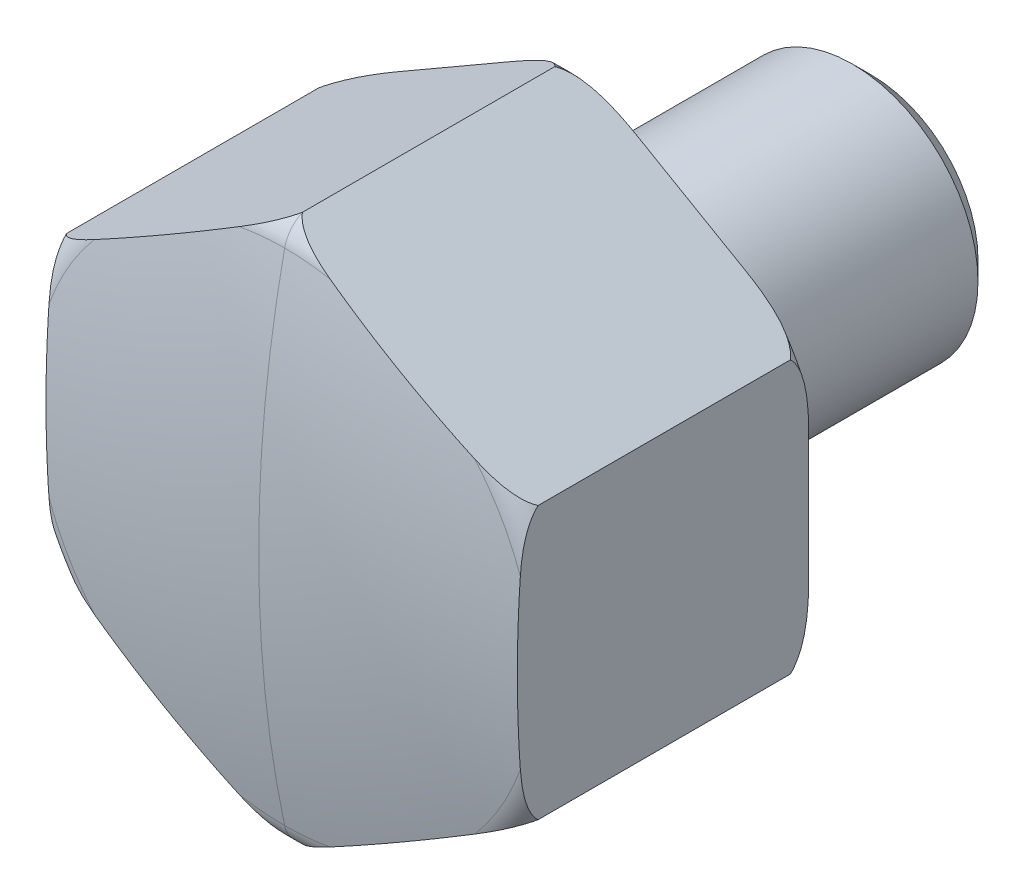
ISO-10303-21;
HEADER;
FILE_DESCRIPTION(('STEP AP214'),'2;1');
FILE_NAME('part.step','',(''),(''),'','','');
FILE_SCHEMA(('AUTOMOTIVE_DESIGN { 1 0 10303 214 1 1 1 1 }'));
ENDSEC;
DATA;
#1=APPLICATION_CONTEXT('core data for automotive mechanical design processes');
#2=APPLICATION_PROTOCOL_DEFINITION('international standard','automotive_design',2000,#1);
#3=PRODUCT_CONTEXT('',#1,'mechanical');
#4=PRODUCT('Part','Part','',(#3));
#5=PRODUCT_RELATED_PRODUCT_CATEGORY('part','',(#4));
#6=PRODUCT_DEFINITION_FORMATION('','',#4);
#7=PRODUCT_DEFINITION_CONTEXT('part definition',#1,'design');
#8=PRODUCT_DEFINITION('design','',#6,#7);
#9=PRODUCT_DEFINITION_SHAPE('','',#8);
#10=(LENGTH_UNIT() NAMED_UNIT(*) SI_UNIT(.MILLI.,.METRE.));
#11=(NAMED_UNIT(*) PLANE_ANGLE_UNIT() SI_UNIT($,.RADIAN.));
#12=(NAMED_UNIT(*) SI_UNIT($,.STERADIAN.) SOLID_ANGLE_UNIT());
#13=UNCERTAINTY_MEASURE_WITH_UNIT(LENGTH_MEASURE(1.E-05),#10,'distance_accuracy_value','');
#14=(GEOMETRIC_REPRESENTATION_CONTEXT(3) GLOBAL_UNCERTAINTY_ASSIGNED_CONTEXT((#13)) GLOBAL_UNIT_ASSIGNED_CONTEXT((#10,
#11,#12)) REPRESENTATION_CONTEXT('',''));
#15=CARTESIAN_POINT('',(0.,0.,0.));
#16=DIRECTION('',(0.,0.,1.));
#17=DIRECTION('',(1.,0.,0.));
#18=AXIS2_PLACEMENT_3D('',#15,#16,#17);
#19=CARTESIAN_POINT('',(6.773,-6.85427810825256,-19.));
#20=DIRECTION('',(0.,0.,-1.));
#21=DIRECTION('',(-1.,0.,0.));
#22=AXIS2_PLACEMENT_3D('',#19,#20,#21);
#23=PLANE('',#22);
#24=CARTESIAN_POINT('',(0.,0.,-19.));
#25=DIRECTION('',(0.,0.,1.));
#26=DIRECTION('',(0.,-1.,0.));
#27=AXIS2_PLACEMENT_3D('',#24,#25,#26);
#28=CIRCLE('',#27,6.773);
#29=CARTESIAN_POINT('',(0.,-6.773,-19.));
#30=VERTEX_POINT('',#29);
#31=EDGE_CURVE('E17',#30,#30,#28,.T.);
#32=ORIENTED_EDGE('',*,*,#31,.F.);
#33=EDGE_LOOP('',(#32));
#34=FACE_BOUND('',#33,.T.);
#35=ADVANCED_FACE('F14',(#34),#23,.T.);
#36=CARTESIAN_POINT('',(0.,0.,-19.));
#37=DIRECTION('',(0.,0.,1.));
#38=DIRECTION('',(0.,-1.,0.));
#39=AXIS2_PLACEMENT_3D('',#36,#37,#38);
#40=CONICAL_SURFACE('',#39,6.773,0.785398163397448);
#41=ORIENTED_EDGE('',*,*,#31,.T.);
#42=EDGE_LOOP('',(#41));
#43=FACE_BOUND('',#42,.T.);
#44=CARTESIAN_POINT('',(0.,0.,-17.773));
#45=DIRECTION('',(0.,0.,1.));
#46=DIRECTION('',(1.,0.,0.));
#47=AXIS2_PLACEMENT_3D('',#44,#45,#46);
#48=CIRCLE('',#47,8.);
#49=CARTESIAN_POINT('',(8.,0.,-17.773));
#50=VERTEX_POINT('',#49);
#51=EDGE_CURVE('E163',#50,#50,#48,.T.);
#52=ORIENTED_EDGE('',*,*,#51,.F.);
#53=EDGE_LOOP('',(#52));
#54=FACE_BOUND('',#53,.T.);
#55=ADVANCED_FACE('F841',(#43,#54),#40,.T.);
#56=CARTESIAN_POINT('',(0.,0.,16.3990649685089));
#57=DIRECTION('',(0.,0.,1.));
#58=DIRECTION('',(0.,-1.,0.));
#59=AXIS2_PLACEMENT_3D('',#56,#57,#58);
#60=TOROIDAL_SURFACE('',#59,15.5,2.);
#61=CARTESIAN_POINT('',(2.8897519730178,-15.6521089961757,18.355188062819));
#62=CARTESIAN_POINT('',(2.78832478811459,-15.7106680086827,18.3468308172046));
#63=CARTESIAN_POINT('',(2.68697008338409,-15.7691851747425,18.337032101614));
#64=CARTESIAN_POINT('',(2.48409247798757,-15.8863166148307,18.3139157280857));
#65=CARTESIAN_POINT('',(2.38257095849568,-15.9449300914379,18.3005820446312));
#66=CARTESIAN_POINT('',(2.17980432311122,-16.0619974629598,18.2697985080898));
#67=CARTESIAN_POINT('',(2.07856002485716,-16.1204508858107,18.2523413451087));
#68=CARTESIAN_POINT('',(1.87219559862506,-16.239595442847,18.2117089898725));
#69=CARTESIAN_POINT('',(1.76710791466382,-16.3002678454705,18.1883103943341));
#70=CARTESIAN_POINT('',(1.55825434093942,-16.4208495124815,18.1353259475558));
#71=CARTESIAN_POINT('',(1.4544867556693,-16.4807597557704,18.1057491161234));
#72=CARTESIAN_POINT('',(1.24882308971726,-16.5994997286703,18.0392550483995));
#73=CARTESIAN_POINT('',(1.14692495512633,-16.6583306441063,18.0023464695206));
#74=CARTESIAN_POINT('',(0.979134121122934,-16.7552047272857,17.9334074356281));
#75=CARTESIAN_POINT('',(0.912492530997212,-16.793680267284,17.9038090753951));
#76=CARTESIAN_POINT('',(0.780793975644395,-16.8697164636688,17.8401314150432));
#77=CARTESIAN_POINT('',(0.715737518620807,-16.9072768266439,17.8060506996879));
#78=CARTESIAN_POINT('',(0.588581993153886,-16.9806901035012,17.7332631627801));
#79=CARTESIAN_POINT('',(0.526456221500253,-17.0165584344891,17.6946190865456));
#80=CARTESIAN_POINT('',(0.405101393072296,-17.0866226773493,17.6117284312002));
#81=CARTESIAN_POINT('',(0.345870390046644,-17.1208197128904,17.5674856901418));
#82=CARTESIAN_POINT('',(0.236675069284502,-17.1838636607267,17.4770605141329));
#83=CARTESIAN_POINT('',(0.186362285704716,-17.2129117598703,17.4314471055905));
#84=CARTESIAN_POINT('',(0.11397011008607,-17.254707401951,17.3585069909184));
#85=CARTESIAN_POINT('',(0.0902614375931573,-17.2683956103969,17.3333276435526));
#86=CARTESIAN_POINT('',(0.0441215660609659,-17.2950344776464,17.281421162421));
#87=CARTESIAN_POINT('',(0.0216912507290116,-17.3079846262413,17.2546929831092));
#88=CARTESIAN_POINT('',(0.,-17.3205080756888,17.227165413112));
#89=B_SPLINE_CURVE_WITH_KNOTS('',3,(#61,#62,#63,#64,#65,#66,#67,#68,#69,#70,#71,#72,#73,#74,#75,
#76,#77,#78,#79,#80,#81,#82,#83,#84,#85,#86,#87,#88),.UNSPECIFIED.,.F.,.F.,(4,2,2,2,2,2,2,2,2,2,
2,2,2,4),(0.,0.352267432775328,0.706159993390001,1.0606846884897,1.4312865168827,
1.80135102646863,2.17098112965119,2.4182067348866,2.66551058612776,2.90974148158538,
3.1538058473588,3.37502907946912,3.48655895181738,3.5981650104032),.UNSPECIFIED.);
#90=CARTESIAN_POINT('',(2.8897519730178,-15.6521089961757,18.355188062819));
#91=VERTEX_POINT('',#90);
#92=CARTESIAN_POINT('',(0.,-17.3205080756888,17.2271654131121));
#93=VERTEX_POINT('',#92);
#94=EDGE_CURVE('E548',#91,#93,#89,.T.);
#95=ORIENTED_EDGE('',*,*,#94,.F.);
#96=CARTESIAN_POINT('',(0.,0.,18.355188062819));
#97=DIRECTION('',(0.,0.,1.));
#98=DIRECTION('',(0.,-1.,0.));
#99=AXIS2_PLACEMENT_3D('',#96,#97,#98);
#100=CIRCLE('',#99,15.9166322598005);
#101=CARTESIAN_POINT('',(0.,-15.9166322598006,18.355188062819));
#102=VERTEX_POINT('',#101);
#103=EDGE_CURVE('E1005',#102,#91,#100,.T.);
#104=ORIENTED_EDGE('',*,*,#103,.F.);
#105=CARTESIAN_POINT('',(0.,-15.5,16.3990649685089));
#106=DIRECTION('',(1.,0.,0.));
#107=DIRECTION('',(0.,1.,0.));
#108=AXIS2_PLACEMENT_3D('',#105,#106,#107);
#109=CIRCLE('',#108,2.);
#110=EDGE_CURVE('E334',#93,#102,#109,.F.);
#111=ORIENTED_EDGE('',*,*,#110,.F.);
#112=EDGE_LOOP('',(#95,#104,#111));
#113=FACE_BOUND('',#112,.T.);
#114=ADVANCED_FACE('F340',(#113),#60,.T.);
#115=CARTESIAN_POINT('',(0.,0.,16.3990649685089));
#116=DIRECTION('',(0.,0.,1.));
#117=DIRECTION('',(0.,-1.,0.));
#118=AXIS2_PLACEMENT_3D('',#115,#116,#117);
#119=TOROIDAL_SURFACE('',#118,15.5,2.);
#120=CARTESIAN_POINT('',(0.,0.,18.355188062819));
#121=DIRECTION('',(0.,0.,1.));
#122=DIRECTION('',(0.,-1.,0.));
#123=AXIS2_PLACEMENT_3D('',#120,#121,#122);
#124=CIRCLE('',#123,15.9166322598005);
#125=CARTESIAN_POINT('',(-2.88975197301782,-15.6521089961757,18.355188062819));
#126=VERTEX_POINT('',#125);
#127=EDGE_CURVE('E219',#126,#102,#124,.T.);
#128=ORIENTED_EDGE('',*,*,#127,.F.);
#129=CARTESIAN_POINT('',(0.,-17.3205080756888,17.227165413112));
#130=CARTESIAN_POINT('',(-0.0339298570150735,-17.3009186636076,17.2702031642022));
#131=CARTESIAN_POINT('',(-0.0696360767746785,-17.2803036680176,17.3112832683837));
#132=CARTESIAN_POINT('',(-0.143758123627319,-17.2375092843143,17.3895686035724));
#133=CARTESIAN_POINT('',(-0.182158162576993,-17.2153390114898,17.4267936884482));
#134=CARTESIAN_POINT('',(-0.26115656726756,-17.1697292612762,17.49782586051));
#135=CARTESIAN_POINT('',(-0.301752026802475,-17.1462914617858,17.531637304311));
#136=CARTESIAN_POINT('',(-0.384015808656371,-17.0987964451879,17.595612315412));
#137=CARTESIAN_POINT('',(-0.42565332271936,-17.0747570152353,17.6258289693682));
#138=CARTESIAN_POINT('',(-0.510372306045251,-17.0258444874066,17.6835669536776));
#139=CARTESIAN_POINT('',(-0.553455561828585,-17.0009703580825,17.7110847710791));
#140=CARTESIAN_POINT('',(-0.640771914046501,-16.9505582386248,17.763627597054));
#141=CARTESIAN_POINT('',(-0.685005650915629,-16.9250198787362,17.7886511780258));
#142=CARTESIAN_POINT('',(-0.800946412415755,-16.858081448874,17.8505932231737));
#143=CARTESIAN_POINT('',(-0.873362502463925,-16.8162719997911,17.8857460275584));
#144=CARTESIAN_POINT('',(-1.01986534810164,-16.7316885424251,17.9509751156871));
#145=CARTESIAN_POINT('',(-1.09395209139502,-16.6889145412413,17.9810514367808));
#146=CARTESIAN_POINT('',(-1.24336751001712,-16.6026495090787,18.0367742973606));
#147=CARTESIAN_POINT('',(-1.31869635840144,-16.5591583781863,18.062420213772));
#148=CARTESIAN_POINT('',(-1.47113639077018,-16.4711470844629,18.1100930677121));
#149=CARTESIAN_POINT('',(-1.5482581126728,-16.4266208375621,18.1320746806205));
#150=CARTESIAN_POINT('',(-1.70316469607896,-16.3371854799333,18.1725294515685));
#151=CARTESIAN_POINT('',(-1.78094939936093,-16.2922764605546,18.1910034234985));
#152=CARTESIAN_POINT('',(-1.93700939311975,-16.2021751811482,18.2248592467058));
#153=CARTESIAN_POINT('',(-2.01528464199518,-16.1569829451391,18.2402413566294));
#154=CARTESIAN_POINT('',(-2.22661442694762,-16.034971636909,18.2780052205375));
#155=CARTESIAN_POINT('',(-2.36001245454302,-15.9579542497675,18.2978433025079));
#156=CARTESIAN_POINT('',(-2.55958736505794,-15.8427296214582,18.3227336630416));
#157=CARTESIAN_POINT('',(-2.62555491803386,-15.8046432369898,18.330182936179));
#158=CARTESIAN_POINT('',(-2.75758571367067,-15.7284152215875,18.3436906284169));
#159=CARTESIAN_POINT('',(-2.82364893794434,-15.6902736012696,18.3497492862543));
#160=CARTESIAN_POINT('',(-2.8897519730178,-15.6521089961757,18.355188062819));
#161=B_SPLINE_CURVE_WITH_KNOTS('',3,(#129,#130,#131,#132,#133,#134,#135,#136,#137,#138,#139,
#140,#141,#142,#143,#144,#145,#146,#147,#148,#149,#150,#151,#152,#153,#154,#155,#156,#157,#158,
#159,#160),.UNSPECIFIED.,.F.,.F.,(4,2,2,2,2,2,2,2,2,2,2,2,2,2,2,4),(0.,0.174434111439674,
0.347919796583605,0.521181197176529,0.691438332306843,0.861914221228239,1.03248713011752,
1.30439947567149,1.5763098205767,1.84825837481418,2.12335466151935,2.39838703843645,
2.67339639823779,3.13912510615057,3.36872511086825,3.5982856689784),.UNSPECIFIED.);
#162=EDGE_CURVE('E345',#93,#126,#161,.T.);
#163=ORIENTED_EDGE('',*,*,#162,.F.);
#164=ORIENTED_EDGE('',*,*,#110,.T.);
#165=EDGE_LOOP('',(#128,#163,#164));
#166=FACE_BOUND('',#165,.T.);
#167=ADVANCED_FACE('F336',(#166),#119,.T.);
#168=CARTESIAN_POINT('',(0.,0.,16.3990649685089));
#169=DIRECTION('',(0.,0.,1.));
#170=DIRECTION('',(0.,-1.,0.));
#171=AXIS2_PLACEMENT_3D('',#168,#169,#170);
#172=TOROIDAL_SURFACE('',#171,15.5,2.);
#173=CARTESIAN_POINT('',(0.,0.,18.355188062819));
#174=DIRECTION('',(0.,0.,1.));
#175=DIRECTION('',(0.,-1.,0.));
#176=AXIS2_PLACEMENT_3D('',#173,#174,#175);
#177=CIRCLE('',#176,15.9166322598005);
#178=CARTESIAN_POINT('',(-15.,-5.32345587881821,18.355188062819));
#179=VERTEX_POINT('',#178);
#180=CARTESIAN_POINT('',(-12.1102480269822,-10.3286531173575,18.355188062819));
#181=VERTEX_POINT('',#180);
#182=EDGE_CURVE('E408',#179,#181,#177,.T.);
#183=ORIENTED_EDGE('',*,*,#182,.F.);
#184=CARTESIAN_POINT('',(-15.,-8.6602540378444,17.227165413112));
#185=CARTESIAN_POINT('',(-15.,-8.62107521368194,17.2702031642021));
#186=CARTESIAN_POINT('',(-15.,-8.57984522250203,17.3112832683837));
#187=CARTESIAN_POINT('',(-15.,-8.49425645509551,17.3895686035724));
#188=CARTESIAN_POINT('',(-15.,-8.44991590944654,17.4267936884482));
#189=CARTESIAN_POINT('',(-15.,-8.35869640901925,17.4978258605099));
#190=CARTESIAN_POINT('',(-15.,-8.31182081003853,17.531637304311));
#191=CARTESIAN_POINT('',(-15.,-8.21683077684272,17.595612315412));
#192=CARTESIAN_POINT('',(-15.,-8.16875191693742,17.6258289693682));
#193=CARTESIAN_POINT('',(-15.,-8.07092686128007,17.6835669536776));
#194=CARTESIAN_POINT('',(-15.,-8.02117860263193,17.7110847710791));
#195=CARTESIAN_POINT('',(-15.,-7.92035436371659,17.763627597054));
#196=CARTESIAN_POINT('',(-15.,-7.86927764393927,17.7886511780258));
#197=CARTESIAN_POINT('',(-15.,-7.73540078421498,17.8505932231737));
#198=CARTESIAN_POINT('',(-15.,-7.65178188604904,17.8857460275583));
#199=CARTESIAN_POINT('',(-15.,-7.48261497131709,17.9509751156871));
#200=CARTESIAN_POINT('',(-15.,-7.39706696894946,17.9810514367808));
#201=CARTESIAN_POINT('',(-15.,-7.22453690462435,18.0367742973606));
#202=CARTESIAN_POINT('',(-15.,-7.1375546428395,18.062420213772));
#203=CARTESIAN_POINT('',(-15.,-6.96153205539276,18.1100930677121));
#204=CARTESIAN_POINT('',(-15.,-6.87247956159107,18.1320746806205));
#205=CARTESIAN_POINT('',(-15.,-6.69360884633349,18.1725294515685));
#206=CARTESIAN_POINT('',(-15.,-6.60379080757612,18.1910034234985));
#207=CARTESIAN_POINT('',(-15.,-6.42358824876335,18.2248592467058));
#208=CARTESIAN_POINT('',(-15.,-6.33320377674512,18.2402413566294));
#209=CARTESIAN_POINT('',(-15.,-6.08918116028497,18.2780052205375));
#210=CARTESIAN_POINT('',(-15.,-5.93514638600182,18.2978433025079));
#211=CARTESIAN_POINT('',(-15.,-5.70469712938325,18.3227336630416));
#212=CARTESIAN_POINT('',(-15.,-5.62852436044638,18.330182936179));
#213=CARTESIAN_POINT('',(-15.,-5.47606832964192,18.3436906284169));
#214=CARTESIAN_POINT('',(-15.,-5.39978508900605,18.3497492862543));
#215=CARTESIAN_POINT('',(-15.,-5.32345587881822,18.355188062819));
#216=B_SPLINE_CURVE_WITH_KNOTS('',3,(#184,#185,#186,#187,#188,#189,#190,#191,#192,#193,#194,
#195,#196,#197,#198,#199,#200,#201,#202,#203,#204,#205,#206,#207,#208,#209,#210,#211,#212,#213,
#214,#215),.UNSPECIFIED.,.F.,.F.,(4,2,2,2,2,2,2,2,2,2,2,2,2,2,2,4),(0.,0.174434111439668,
0.347919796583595,0.521181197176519,0.69143833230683,0.861914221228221,1.0324871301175,
1.30439947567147,1.57630982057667,1.84825837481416,2.12335466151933,2.39838703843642,
2.67339639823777,3.13912510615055,3.36872511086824,3.5982856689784),.UNSPECIFIED.);
#217=CARTESIAN_POINT('',(-15.,-8.66025403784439,17.227165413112));
#218=VERTEX_POINT('',#217);
#219=EDGE_CURVE('E414',#218,#179,#216,.T.);
#220=ORIENTED_EDGE('',*,*,#219,.F.);
#221=CARTESIAN_POINT('',(-12.1102480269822,-10.3286531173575,18.355188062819));
#222=CARTESIAN_POINT('',(-12.2116752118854,-10.2700941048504,18.3468308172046));
#223=CARTESIAN_POINT('',(-12.3130299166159,-10.2115769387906,18.337032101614));
#224=CARTESIAN_POINT('',(-12.5159075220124,-10.0944454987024,18.3139157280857));
#225=CARTESIAN_POINT('',(-12.6174290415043,-10.0358320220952,18.3005820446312));
#226=CARTESIAN_POINT('',(-12.8201956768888,-9.91876465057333,18.2697985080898));
#227=CARTESIAN_POINT('',(-12.9214399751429,-9.86031122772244,18.2523413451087));
#228=CARTESIAN_POINT('',(-13.1278044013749,-9.74116667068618,18.2117089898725));
#229=CARTESIAN_POINT('',(-13.2328920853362,-9.68049426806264,18.1883103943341));
#230=CARTESIAN_POINT('',(-13.4417456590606,-9.55991260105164,18.1353259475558));
#231=CARTESIAN_POINT('',(-13.5455132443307,-9.50000235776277,18.1057491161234));
#232=CARTESIAN_POINT('',(-13.7511769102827,-9.38126238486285,18.0392550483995));
#233=CARTESIAN_POINT('',(-13.8530750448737,-9.32243146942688,18.0023464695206));
#234=CARTESIAN_POINT('',(-14.0208658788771,-9.22555738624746,17.9334074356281));
#235=CARTESIAN_POINT('',(-14.0875074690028,-9.18708184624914,17.9038090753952));
#236=CARTESIAN_POINT('',(-14.2192060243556,-9.11104564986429,17.8401314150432));
#237=CARTESIAN_POINT('',(-14.2842624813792,-9.07348528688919,17.8060506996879));
#238=CARTESIAN_POINT('',(-14.4114180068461,-9.00007201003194,17.7332631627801));
#239=CARTESIAN_POINT('',(-14.4735437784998,-8.96420367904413,17.6946190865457));
#240=CARTESIAN_POINT('',(-14.5948986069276,-8.89413943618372,17.6117284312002));
#241=CARTESIAN_POINT('',(-14.6541296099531,-8.8599424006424,17.5674856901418));
#242=CARTESIAN_POINT('',(-14.7633249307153,-8.79689845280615,17.4770605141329));
#243=CARTESIAN_POINT('',(-14.8136377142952,-8.76785035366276,17.4314471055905));
#244=CARTESIAN_POINT('',(-14.886029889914,-8.72605471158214,17.3585069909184));
#245=CARTESIAN_POINT('',(-14.9097385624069,-8.71236650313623,17.3333276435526));
#246=CARTESIAN_POINT('',(-14.955878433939,-8.68572763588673,17.281421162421));
#247=CARTESIAN_POINT('',(-14.978308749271,-8.67277748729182,17.2546929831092));
#248=CARTESIAN_POINT('',(-15.,-8.66025403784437,17.227165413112));
#249=B_SPLINE_CURVE_WITH_KNOTS('',3,(#221,#222,#223,#224,#225,#226,#227,#228,#229,#230,#231,
#232,#233,#234,#235,#236,#237,#238,#239,#240,#241,#242,#243,#244,#245,#246,#247,#248),
.UNSPECIFIED.,.F.,.F.,(4,2,2,2,2,2,2,2,2,2,2,2,2,4),(0.,0.352267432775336,0.706159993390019,
1.06068468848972,1.43128651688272,1.80135102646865,2.17098112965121,2.4182067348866,
2.66551058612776,2.90974148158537,3.15380584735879,3.37502907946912,3.48655895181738,
3.59816501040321),.UNSPECIFIED.);
#250=EDGE_CURVE('E393',#181,#218,#249,.T.);
#251=ORIENTED_EDGE('',*,*,#250,.F.);
#252=EDGE_LOOP('',(#183,#220,#251));
#253=FACE_BOUND('',#252,.T.);
#254=ADVANCED_FACE('F313',(#253),#172,.T.);
#255=CARTESIAN_POINT('',(0.,0.,16.3990649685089));
#256=DIRECTION('',(0.,0.,1.));
#257=DIRECTION('',(0.,-1.,0.));
#258=AXIS2_PLACEMENT_3D('',#255,#256,#257);
#259=TOROIDAL_SURFACE('',#258,15.5,2.);
#260=CARTESIAN_POINT('',(-2.88975197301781,15.6521089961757,18.355188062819));
#261=CARTESIAN_POINT('',(-2.78832478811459,15.7106680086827,18.3468308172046));
#262=CARTESIAN_POINT('',(-2.68697008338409,15.7691851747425,18.337032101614));
#263=CARTESIAN_POINT('',(-2.48409247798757,15.8863166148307,18.3139157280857));
#264=CARTESIAN_POINT('',(-2.38257095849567,15.9449300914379,18.3005820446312));
#265=CARTESIAN_POINT('',(-2.17980432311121,16.0619974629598,18.2697985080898));
#266=CARTESIAN_POINT('',(-2.07856002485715,16.1204508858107,18.2523413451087));
#267=CARTESIAN_POINT('',(-1.87219559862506,16.239595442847,18.2117089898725));
#268=CARTESIAN_POINT('',(-1.76710791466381,16.3002678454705,18.1883103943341));
#269=CARTESIAN_POINT('',(-1.55825434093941,16.4208495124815,18.1353259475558));
#270=CARTESIAN_POINT('',(-1.45448675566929,16.4807597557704,18.1057491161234));
#271=CARTESIAN_POINT('',(-1.24882308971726,16.5994997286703,18.0392550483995));
#272=CARTESIAN_POINT('',(-1.14692495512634,16.6583306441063,18.0023464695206));
#273=CARTESIAN_POINT('',(-0.979134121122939,16.7552047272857,17.9334074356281));
#274=CARTESIAN_POINT('',(-0.912492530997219,16.793680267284,17.9038090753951));
#275=CARTESIAN_POINT('',(-0.780793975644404,16.8697164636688,17.8401314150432));
#276=CARTESIAN_POINT('',(-0.715737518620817,16.9072768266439,17.8060506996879));
#277=CARTESIAN_POINT('',(-0.588581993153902,16.9806901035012,17.7332631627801));
#278=CARTESIAN_POINT('',(-0.526456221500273,17.0165584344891,17.6946190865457));
#279=CARTESIAN_POINT('',(-0.40510139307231,17.0866226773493,17.6117284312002));
#280=CARTESIAN_POINT('',(-0.345870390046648,17.1208197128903,17.5674856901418));
#281=CARTESIAN_POINT('',(-0.236675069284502,17.1838636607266,17.4770605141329));
#282=CARTESIAN_POINT('',(-0.186362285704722,17.2129117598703,17.4314471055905));
#283=CARTESIAN_POINT('',(-0.113970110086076,17.254707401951,17.3585069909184));
#284=CARTESIAN_POINT('',(-0.0902614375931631,17.2683956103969,17.3333276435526));
#285=CARTESIAN_POINT('',(-0.0441215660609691,17.2950344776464,17.281421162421));
#286=CARTESIAN_POINT('',(-0.0216912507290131,17.3079846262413,17.2546929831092));
#287=CARTESIAN_POINT('',(0.,17.3205080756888,17.227165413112));
#288=B_SPLINE_CURVE_WITH_KNOTS('',3,(#260,#261,#262,#263,#264,#265,#266,#267,#268,#269,#270,
#271,#272,#273,#274,#275,#276,#277,#278,#279,#280,#281,#282,#283,#284,#285,#286,#287),
.UNSPECIFIED.,.F.,.F.,(4,2,2,2,2,2,2,2,2,2,2,2,2,4),(0.,0.352267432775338,0.706159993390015,
1.06068468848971,1.43128651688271,1.80135102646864,2.17098112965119,2.41820673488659,
2.66551058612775,2.90974148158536,3.15380584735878,3.37502907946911,3.48655895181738,
3.59816501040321),.UNSPECIFIED.);
#289=CARTESIAN_POINT('',(-2.8897519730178,15.6521089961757,18.355188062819));
#290=VERTEX_POINT('',#289);
#291=CARTESIAN_POINT('',(0.,17.3205080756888,17.2271654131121));
#292=VERTEX_POINT('',#291);
#293=EDGE_CURVE('E298',#290,#292,#288,.T.);
#294=ORIENTED_EDGE('',*,*,#293,.F.);
#295=CARTESIAN_POINT('',(0.,0.,18.355188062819));
#296=DIRECTION('',(0.,0.,1.));
#297=DIRECTION('',(0.,-1.,0.));
#298=AXIS2_PLACEMENT_3D('',#295,#296,#297);
#299=CIRCLE('',#298,15.9166322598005);
#300=CARTESIAN_POINT('',(0.,15.9166322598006,18.355188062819));
#301=VERTEX_POINT('',#300);
#302=EDGE_CURVE('E864',#301,#290,#299,.T.);
#303=ORIENTED_EDGE('',*,*,#302,.F.);
#304=CARTESIAN_POINT('',(0.,15.5,16.3990649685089));
#305=DIRECTION('',(-1.,0.,0.));
#306=DIRECTION('',(0.,-1.,0.));
#307=AXIS2_PLACEMENT_3D('',#304,#305,#306);
#308=CIRCLE('',#307,2.);
#309=EDGE_CURVE('E215',#292,#301,#308,.F.);
#310=ORIENTED_EDGE('',*,*,#309,.F.);
#311=EDGE_LOOP('',(#294,#303,#310));
#312=FACE_BOUND('',#311,.T.);
#313=ADVANCED_FACE('F308',(#312),#259,.T.);
#314=CARTESIAN_POINT('',(0.,0.,16.3990649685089));
#315=DIRECTION('',(0.,0.,1.));
#316=DIRECTION('',(0.,-1.,0.));
#317=AXIS2_PLACEMENT_3D('',#314,#315,#316);
#318=TOROIDAL_SURFACE('',#317,15.5,2.);
#319=CARTESIAN_POINT('',(-15.,5.32345587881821,18.355188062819));
#320=CARTESIAN_POINT('',(-15.,5.44057390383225,18.3468308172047));
#321=CARTESIAN_POINT('',(-15.,5.55760823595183,18.337032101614));
#322=CARTESIAN_POINT('',(-15.,5.79187111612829,18.3139157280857));
#323=CARTESIAN_POINT('',(-15.,5.90909806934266,18.3005820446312));
#324=CARTESIAN_POINT('',(-15.,6.14323281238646,18.2697985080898));
#325=CARTESIAN_POINT('',(-15.,6.26013965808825,18.2523413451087));
#326=CARTESIAN_POINT('',(-15.,6.49842877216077,18.2117089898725));
#327=CARTESIAN_POINT('',(-15.,6.61977357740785,18.1883103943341));
#328=CARTESIAN_POINT('',(-15.,6.86093691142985,18.1353259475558));
#329=CARTESIAN_POINT('',(-15.,6.98075739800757,18.1057491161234));
#330=CARTESIAN_POINT('',(-15.,7.21823734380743,18.0392550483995));
#331=CARTESIAN_POINT('',(-15.,7.3358991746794,18.0023464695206));
#332=CARTESIAN_POINT('',(-15.,7.52964734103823,17.9334074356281));
#333=CARTESIAN_POINT('',(-15.,7.60659842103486,17.9038090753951));
#334=CARTESIAN_POINT('',(-15.,7.75867081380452,17.8401314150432));
#335=CARTESIAN_POINT('',(-15.,7.83379153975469,17.8060506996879));
#336=CARTESIAN_POINT('',(-15.,7.98061809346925,17.7332631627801));
#337=CARTESIAN_POINT('',(-15.0000000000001,8.05235475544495,17.6946190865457));
#338=CARTESIAN_POINT('',(-14.9999999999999,8.19248324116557,17.6117284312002));
#339=CARTESIAN_POINT('',(-14.9999999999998,8.26087731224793,17.5674856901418));
#340=CARTESIAN_POINT('',(-14.9999999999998,8.38696520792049,17.4770605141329));
#341=CARTESIAN_POINT('',(-15.,8.44506140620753,17.4314471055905));
#342=CARTESIAN_POINT('',(-15.,8.52865269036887,17.3585069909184));
#343=CARTESIAN_POINT('',(-15.,8.55602910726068,17.3333276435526));
#344=CARTESIAN_POINT('',(-15.,8.60930684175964,17.281421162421));
#345=CARTESIAN_POINT('',(-15.,8.63520713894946,17.2546929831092));
#346=CARTESIAN_POINT('',(-15.,8.6602540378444,17.227165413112));
#347=B_SPLINE_CURVE_WITH_KNOTS('',3,(#319,#320,#321,#322,#323,#324,#325,#326,#327,#328,#329,
#330,#331,#332,#333,#334,#335,#336,#337,#338,#339,#340,#341,#342,#343,#344,#345,#346),
.UNSPECIFIED.,.F.,.F.,(4,2,2,2,2,2,2,2,2,2,2,2,2,4),(0.,0.352267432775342,0.706159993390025,
1.06068468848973,1.43128651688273,1.80135102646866,2.17098112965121,2.41820673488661,
2.66551058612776,2.90974148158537,3.15380584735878,3.37502907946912,3.48655895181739,
3.59816501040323),.UNSPECIFIED.);
#348=CARTESIAN_POINT('',(-15.,5.3234558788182,18.355188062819));
#349=VERTEX_POINT('',#348);
#350=CARTESIAN_POINT('',(-15.,8.6602540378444,17.227165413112));
#351=VERTEX_POINT('',#350);
#352=EDGE_CURVE('E416',#349,#351,#347,.T.);
#353=ORIENTED_EDGE('',*,*,#352,.F.);
#354=CARTESIAN_POINT('',(0.,0.,18.355188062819));
#355=DIRECTION('',(0.,0.,1.));
#356=DIRECTION('',(0.,-1.,0.));
#357=AXIS2_PLACEMENT_3D('',#354,#355,#356);
#358=CIRCLE('',#357,15.9166322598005);
#359=CARTESIAN_POINT('',(-12.1102480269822,10.3286531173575,18.355188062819));
#360=VERTEX_POINT('',#359);
#361=EDGE_CURVE('E412',#360,#349,#358,.T.);
#362=ORIENTED_EDGE('',*,*,#361,.F.);
#363=CARTESIAN_POINT('',(-15.,8.6602540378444,17.227165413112));
#364=CARTESIAN_POINT('',(-14.9660701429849,8.67984344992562,17.2702031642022));
#365=CARTESIAN_POINT('',(-14.9303639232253,8.70045844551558,17.3112832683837));
#366=CARTESIAN_POINT('',(-14.8562418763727,8.74325282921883,17.3895686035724));
#367=CARTESIAN_POINT('',(-14.817841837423,8.76542310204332,17.4267936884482));
#368=CARTESIAN_POINT('',(-14.7388434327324,8.81103285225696,17.4978258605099));
#369=CARTESIAN_POINT('',(-14.6982479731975,8.83447065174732,17.531637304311));
#370=CARTESIAN_POINT('',(-14.6159841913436,8.88196566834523,17.595612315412));
#371=CARTESIAN_POINT('',(-14.5743466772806,8.90600509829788,17.6258289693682));
#372=CARTESIAN_POINT('',(-14.4896276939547,8.95491762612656,17.6835669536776));
#373=CARTESIAN_POINT('',(-14.4465444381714,8.97979175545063,17.7110847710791));
#374=CARTESIAN_POINT('',(-14.3592280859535,9.03020387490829,17.763627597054));
#375=CARTESIAN_POINT('',(-14.3149943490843,9.05574223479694,17.7886511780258));
#376=CARTESIAN_POINT('',(-14.1990535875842,9.12268066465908,17.8505932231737));
#377=CARTESIAN_POINT('',(-14.1266374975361,9.16449011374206,17.8857460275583));
#378=CARTESIAN_POINT('',(-13.9801346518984,9.24907357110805,17.9509751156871));
#379=CARTESIAN_POINT('',(-13.906047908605,9.29184757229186,17.9810514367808));
#380=CARTESIAN_POINT('',(-13.7566324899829,9.37811260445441,18.0367742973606));
#381=CARTESIAN_POINT('',(-13.6813036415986,9.42160373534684,18.062420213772));
#382=CARTESIAN_POINT('',(-13.5288636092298,9.50961502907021,18.1100930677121));
#383=CARTESIAN_POINT('',(-13.4517418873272,9.55414127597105,18.1320746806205));
#384=CARTESIAN_POINT('',(-13.296835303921,9.64357663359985,18.1725294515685));
#385=CARTESIAN_POINT('',(-13.2190506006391,9.68848565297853,18.1910034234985));
#386=CARTESIAN_POINT('',(-13.0629906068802,9.77858693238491,18.2248592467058));
#387=CARTESIAN_POINT('',(-12.9847153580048,9.82377916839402,18.2402413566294));
#388=CARTESIAN_POINT('',(-12.7733855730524,9.94579047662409,18.2780052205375));
#389=CARTESIAN_POINT('',(-12.639987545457,10.0228078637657,18.2978433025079));
#390=CARTESIAN_POINT('',(-12.4404126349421,10.138032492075,18.3227336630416));
#391=CARTESIAN_POINT('',(-12.3744450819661,10.1761188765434,18.330182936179));
#392=CARTESIAN_POINT('',(-12.2424142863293,10.2523468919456,18.3436906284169));
#393=CARTESIAN_POINT('',(-12.1763510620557,10.2904885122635,18.3497492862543));
#394=CARTESIAN_POINT('',(-12.1102480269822,10.3286531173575,18.355188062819));
#395=B_SPLINE_CURVE_WITH_KNOTS('',3,(#363,#364,#365,#366,#367,#368,#369,#370,#371,#372,#373,
#374,#375,#376,#377,#378,#379,#380,#381,#382,#383,#384,#385,#386,#387,#388,#389,#390,#391,#392,
#393,#394),.UNSPECIFIED.,.F.,.F.,(4,2,2,2,2,2,2,2,2,2,2,2,2,2,2,4),(0.,0.174434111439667,
0.347919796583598,0.52118119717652,0.69143833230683,0.861914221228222,1.0324871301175,
1.30439947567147,1.57630982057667,1.84825837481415,2.12335466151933,2.39838703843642,
2.67339639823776,3.13912510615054,3.36872511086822,3.59828566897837),.UNSPECIFIED.);
#396=EDGE_CURVE('E262',#351,#360,#395,.T.);
#397=ORIENTED_EDGE('',*,*,#396,.F.);
#398=EDGE_LOOP('',(#353,#362,#397));
#399=FACE_BOUND('',#398,.T.);
#400=ADVANCED_FACE('F234',(#399),#318,.T.);
#401=CARTESIAN_POINT('',(0.,-0.29292251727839,-54.9994279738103));
#402=DIRECTION('',(1.,0.,0.));
#403=DIRECTION('',(0.,0.00390563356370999,0.999992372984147));
#404=AXIS2_PLACEMENT_3D('',#401,#402,#403);
#405=CIRCLE('',#404,74.9999999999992);
#406=TRIMMED_CURVE('',#405,(PARAMETER_VALUE(0.)),(PARAMETER_VALUE(3.14940394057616)),.T.,.PARAMETER.);
#407=CARTESIAN_POINT('',(0.,0.,-54.9994279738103));
#408=DIRECTION('',(0.,0.,1.));
#409=AXIS1_PLACEMENT('',#407,#408);
#410=SURFACE_OF_REVOLUTION('',#406,#409);
#411=ORIENTED_EDGE('',*,*,#127,.T.);
#412=CARTESIAN_POINT('',(0.,-0.29292251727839,-54.9994279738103));
#413=DIRECTION('',(1.,0.,0.));
#414=DIRECTION('',(0.,0.00390563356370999,0.999992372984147));
#415=AXIS2_PLACEMENT_3D('',#412,#413,#414);
#416=CIRCLE('',#415,74.9999999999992);
#417=CARTESIAN_POINT('',(0.,0.,20.));
#418=VERTEX_POINT('',#417);
#419=EDGE_CURVE('E1007',#418,#102,#416,.T.);
#420=ORIENTED_EDGE('',*,*,#419,.F.);
#421=CARTESIAN_POINT('',(0.,0.29292251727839,-54.9994279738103));
#422=DIRECTION('',(-1.,0.,0.));
#423=DIRECTION('',(0.,-0.00390563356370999,0.999992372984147));
#424=AXIS2_PLACEMENT_3D('',#421,#422,#423);
#425=CIRCLE('',#424,74.9999999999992);
#426=EDGE_CURVE('E218',#301,#418,#425,.F.);
#427=ORIENTED_EDGE('',*,*,#426,.F.);
#428=ORIENTED_EDGE('',*,*,#302,.T.);
#429=CARTESIAN_POINT('',(-12.1102480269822,10.3286531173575,18.355188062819));
#430=CARTESIAN_POINT('',(-11.803044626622,10.5060170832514,18.3804574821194));
#431=CARTESIAN_POINT('',(-11.4956851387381,10.6834711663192,18.4031955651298));
#432=CARTESIAN_POINT('',(-10.8809651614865,11.0383799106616,18.4435938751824));
#433=CARTESIAN_POINT('',(-10.5736048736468,11.2158344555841,18.4612581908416));
#434=CARTESIAN_POINT('',(-9.95888388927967,11.5707437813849,18.4915254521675));
#435=CARTESIAN_POINT('',(-9.65152330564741,11.7481984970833,18.5041314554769));
#436=CARTESIAN_POINT('',(-9.0368021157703,12.1031079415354,18.5242944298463));
#437=CARTESIAN_POINT('',(-8.72944155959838,12.2805626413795,18.5318534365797));
#438=CARTESIAN_POINT('',(-8.11472066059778,12.635471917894,18.5419303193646));
#439=CARTESIAN_POINT('',(-7.80736033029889,12.8129264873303,18.5444492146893));
#440=CARTESIAN_POINT('',(-7.19263966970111,13.1678356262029,18.5444492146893));
#441=CARTESIAN_POINT('',(-6.88527933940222,13.3452901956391,18.5419303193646));
#442=CARTESIAN_POINT('',(-6.27055844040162,13.7001994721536,18.5318534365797));
#443=CARTESIAN_POINT('',(-5.9631978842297,13.8776541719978,18.5242944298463));
#444=CARTESIAN_POINT('',(-5.34847669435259,14.2325636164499,18.5041314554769));
#445=CARTESIAN_POINT('',(-5.04111611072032,14.4100183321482,18.4915254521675));
#446=CARTESIAN_POINT('',(-4.42639512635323,14.7649276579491,18.4612581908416));
#447=CARTESIAN_POINT('',(-4.11903483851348,14.9423822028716,18.4435938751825));
#448=CARTESIAN_POINT('',(-3.50431486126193,15.297290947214,18.4031955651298));
#449=CARTESIAN_POINT('',(-3.19695537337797,15.4747450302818,18.3804574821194));
#450=CARTESIAN_POINT('',(-2.88975197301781,15.6521089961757,18.355188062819));
#451=B_SPLINE_CURVE_WITH_KNOTS('',3,(#429,#430,#431,#432,#433,#434,#435,#436,#437,#438,#439,
#440,#441,#442,#443,#444,#445,#446,#447,#448,#449,#450),.UNSPECIFIED.,.F.,.F.,(4,2,2,2,2,2,2,2,
2,2,4),(0.,1.0668713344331,2.13288051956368,3.1982443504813,4.26317821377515,5.32789669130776,
6.39261516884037,7.45754903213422,8.52291286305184,9.58892204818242,10.6557933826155),.UNSPECIFIED.);
#452=EDGE_CURVE('E252',#360,#290,#451,.T.);
#453=ORIENTED_EDGE('',*,*,#452,.F.);
#454=ORIENTED_EDGE('',*,*,#361,.T.);
#455=CARTESIAN_POINT('',(-15.,-5.3234558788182,18.355188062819));
#456=CARTESIAN_POINT('',(-15.,-4.96872794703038,18.3804574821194));
#457=CARTESIAN_POINT('',(-15.,-4.61381978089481,18.4031955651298));
#458=CARTESIAN_POINT('',(-15.,-3.90400229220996,18.4435938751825));
#459=CARTESIAN_POINT('',(-15.,-3.549093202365,18.4612581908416));
#460=CARTESIAN_POINT('',(-15.,-2.8392745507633,18.4915254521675));
#461=CARTESIAN_POINT('',(-15.,-2.48436511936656,18.5041314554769));
#462=CARTESIAN_POINT('',(-15.,-1.77454623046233,18.5242944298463));
#463=CARTESIAN_POINT('',(-15.,-1.41963683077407,18.5318534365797));
#464=CARTESIAN_POINT('',(-15.,-0.7098182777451,18.5419303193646));
#465=CARTESIAN_POINT('',(-15.,-0.354909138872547,18.5444492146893));
#466=CARTESIAN_POINT('',(-15.,0.354909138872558,18.5444492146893));
#467=CARTESIAN_POINT('',(-15.,0.709818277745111,18.5419303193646));
#468=CARTESIAN_POINT('',(-15.,1.41963683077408,18.5318534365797));
#469=CARTESIAN_POINT('',(-15.,1.77454623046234,18.5242944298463));
#470=CARTESIAN_POINT('',(-15.,2.48436511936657,18.5041314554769));
#471=CARTESIAN_POINT('',(-15.,2.83927455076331,18.4915254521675));
#472=CARTESIAN_POINT('',(-15.,3.54909320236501,18.4612581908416));
#473=CARTESIAN_POINT('',(-15.,3.90400229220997,18.4435938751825));
#474=CARTESIAN_POINT('',(-15.,4.61381978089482,18.4031955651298));
#475=CARTESIAN_POINT('',(-15.,4.96872794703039,18.3804574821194));
#476=CARTESIAN_POINT('',(-15.,5.32345587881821,18.355188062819));
#477=B_SPLINE_CURVE_WITH_KNOTS('',3,(#455,#456,#457,#458,#459,#460,#461,#462,#463,#464,#465,
#466,#467,#468,#469,#470,#471,#472,#473,#474,#475,#476),.UNSPECIFIED.,.F.,.F.,(4,2,2,2,2,2,2,2,
2,2,4),(0.,1.0668713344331,2.13288051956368,3.19824435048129,4.26317821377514,5.32789669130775,
6.39261516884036,7.4575490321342,8.52291286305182,9.5889220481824,10.6557933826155),.UNSPECIFIED.);
#478=EDGE_CURVE('E242',#179,#349,#477,.T.);
#479=ORIENTED_EDGE('',*,*,#478,.F.);
#480=ORIENTED_EDGE('',*,*,#182,.T.);
#481=CARTESIAN_POINT('',(-2.88975197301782,-15.6521089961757,18.355188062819));
#482=CARTESIAN_POINT('',(-3.19695537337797,-15.4747450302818,18.3804574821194));
#483=CARTESIAN_POINT('',(-3.50431486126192,-15.297290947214,18.4031955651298));
#484=CARTESIAN_POINT('',(-4.11903483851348,-14.9423822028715,18.4435938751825));
#485=CARTESIAN_POINT('',(-4.42639512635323,-14.7649276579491,18.4612581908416));
#486=CARTESIAN_POINT('',(-5.04111611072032,-14.4100183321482,18.4915254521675));
#487=CARTESIAN_POINT('',(-5.34847669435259,-14.2325636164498,18.5041314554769));
#488=CARTESIAN_POINT('',(-5.9631978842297,-13.8776541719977,18.5242944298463));
#489=CARTESIAN_POINT('',(-6.27055844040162,-13.7001994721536,18.5318534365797));
#490=CARTESIAN_POINT('',(-6.88527933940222,-13.3452901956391,18.5419303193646));
#491=CARTESIAN_POINT('',(-7.19263966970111,-13.1678356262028,18.5444492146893));
#492=CARTESIAN_POINT('',(-7.80736033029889,-12.8129264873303,18.5444492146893));
#493=CARTESIAN_POINT('',(-8.11472066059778,-12.635471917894,18.5419303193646));
#494=CARTESIAN_POINT('',(-8.72944155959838,-12.2805626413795,18.5318534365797));
#495=CARTESIAN_POINT('',(-9.0368021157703,-12.1031079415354,18.5242944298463));
#496=CARTESIAN_POINT('',(-9.65152330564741,-11.7481984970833,18.5041314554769));
#497=CARTESIAN_POINT('',(-9.95888388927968,-11.5707437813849,18.4915254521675));
#498=CARTESIAN_POINT('',(-10.5736048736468,-11.2158344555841,18.4612581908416));
#499=CARTESIAN_POINT('',(-10.8809651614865,-11.0383799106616,18.4435938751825));
#500=CARTESIAN_POINT('',(-11.4956851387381,-10.6834711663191,18.4031955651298));
#501=CARTESIAN_POINT('',(-11.803044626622,-10.5060170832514,18.3804574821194));
#502=CARTESIAN_POINT('',(-12.1102480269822,-10.3286531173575,18.355188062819));
#503=B_SPLINE_CURVE_WITH_KNOTS('',3,(#481,#482,#483,#484,#485,#486,#487,#488,#489,#490,#491,
#492,#493,#494,#495,#496,#497,#498,#499,#500,#501,#502),.UNSPECIFIED.,.F.,.F.,(4,2,2,2,2,2,2,2,
2,2,4),(0.,1.0668713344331,2.13288051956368,3.19824435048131,4.26317821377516,5.32789669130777,
6.39261516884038,7.45754903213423,8.52291286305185,9.58892204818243,10.6557933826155),.UNSPECIFIED.);
#504=EDGE_CURVE('E353',#126,#181,#503,.T.);
#505=ORIENTED_EDGE('',*,*,#504,.F.);
#506=EDGE_LOOP('',(#411,#420,#427,#428,#453,#454,#479,#480,#505));
#507=FACE_BOUND('',#506,.T.);
#508=ADVANCED_FACE('F230',(#507),#410,.F.);
#509=CARTESIAN_POINT('',(0.,0.,16.3990649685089));
#510=DIRECTION('',(0.,0.,1.));
#511=DIRECTION('',(0.,-1.,0.));
#512=AXIS2_PLACEMENT_3D('',#509,#510,#511);
#513=TOROIDAL_SURFACE('',#512,15.5,2.);
#514=CARTESIAN_POINT('',(0.,0.,18.355188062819));
#515=DIRECTION('',(0.,0.,1.));
#516=DIRECTION('',(0.,-1.,0.));
#517=AXIS2_PLACEMENT_3D('',#514,#515,#516);
#518=CIRCLE('',#517,15.9166322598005);
#519=CARTESIAN_POINT('',(2.8897519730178,15.6521089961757,18.355188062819));
#520=VERTEX_POINT('',#519);
#521=EDGE_CURVE('E996',#520,#301,#518,.T.);
#522=ORIENTED_EDGE('',*,*,#521,.F.);
#523=CARTESIAN_POINT('',(0.,17.3205080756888,17.227165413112));
#524=CARTESIAN_POINT('',(0.0339298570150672,17.3009186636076,17.2702031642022));
#525=CARTESIAN_POINT('',(0.069636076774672,17.2803036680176,17.3112832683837));
#526=CARTESIAN_POINT('',(0.143758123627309,17.2375092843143,17.3895686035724));
#527=CARTESIAN_POINT('',(0.18215816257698,17.2153390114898,17.4267936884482));
#528=CARTESIAN_POINT('',(0.261156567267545,17.1697292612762,17.4978258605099));
#529=CARTESIAN_POINT('',(0.301752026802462,17.1462914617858,17.531637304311));
#530=CARTESIAN_POINT('',(0.384015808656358,17.0987964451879,17.595612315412));
#531=CARTESIAN_POINT('',(0.425653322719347,17.0747570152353,17.6258289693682));
#532=CARTESIAN_POINT('',(0.510372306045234,17.0258444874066,17.6835669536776));
#533=CARTESIAN_POINT('',(0.553455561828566,17.0009703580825,17.7110847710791));
#534=CARTESIAN_POINT('',(0.640771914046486,16.9505582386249,17.763627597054));
#535=CARTESIAN_POINT('',(0.685005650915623,16.9250198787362,17.7886511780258));
#536=CARTESIAN_POINT('',(0.800946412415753,16.8580814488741,17.8505932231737));
#537=CARTESIAN_POINT('',(0.873362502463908,16.8162719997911,17.8857460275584));
#538=CARTESIAN_POINT('',(1.01986534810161,16.7316885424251,17.9509751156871));
#539=CARTESIAN_POINT('',(1.09395209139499,16.6889145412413,17.9810514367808));
#540=CARTESIAN_POINT('',(1.2433675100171,16.6026495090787,18.0367742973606));
#541=CARTESIAN_POINT('',(1.31869635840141,16.5591583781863,18.062420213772));
#542=CARTESIAN_POINT('',(1.47113639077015,16.4711470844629,18.1100930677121));
#543=CARTESIAN_POINT('',(1.54825811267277,16.4266208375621,18.1320746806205));
#544=CARTESIAN_POINT('',(1.70316469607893,16.3371854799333,18.1725294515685));
#545=CARTESIAN_POINT('',(1.7809493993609,16.2922764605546,18.1910034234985));
#546=CARTESIAN_POINT('',(1.93700939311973,16.2021751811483,18.2248592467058));
#547=CARTESIAN_POINT('',(2.01528464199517,16.1569829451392,18.2402413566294));
#548=CARTESIAN_POINT('',(2.22661442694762,16.0349716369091,18.2780052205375));
#549=CARTESIAN_POINT('',(2.36001245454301,15.9579542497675,18.2978433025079));
#550=CARTESIAN_POINT('',(2.55958736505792,15.8427296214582,18.3227336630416));
#551=CARTESIAN_POINT('',(2.62555491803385,15.8046432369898,18.330182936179));
#552=CARTESIAN_POINT('',(2.75758571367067,15.7284152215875,18.3436906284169));
#553=CARTESIAN_POINT('',(2.82364893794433,15.6902736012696,18.3497492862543));
#554=CARTESIAN_POINT('',(2.8897519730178,15.6521089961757,18.355188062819));
#555=B_SPLINE_CURVE_WITH_KNOTS('',3,(#523,#524,#525,#526,#527,#528,#529,#530,#531,#532,#533,
#534,#535,#536,#537,#538,#539,#540,#541,#542,#543,#544,#545,#546,#547,#548,#549,#550,#551,#552,
#553,#554),.UNSPECIFIED.,.F.,.F.,(4,2,2,2,2,2,2,2,2,2,2,2,2,2,2,4),(0.,0.17443411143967,
0.347919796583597,0.521181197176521,0.691438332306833,0.861914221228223,1.0324871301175,
1.30439947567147,1.57630982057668,1.84825837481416,2.12335466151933,2.39838703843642,
2.67339639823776,3.13912510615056,3.36872511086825,3.59828566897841),.UNSPECIFIED.);
#556=EDGE_CURVE('E225',#292,#520,#555,.T.);
#557=ORIENTED_EDGE('',*,*,#556,.F.);
#558=ORIENTED_EDGE('',*,*,#309,.T.);
#559=EDGE_LOOP('',(#522,#557,#558));
#560=FACE_BOUND('',#559,.T.);
#561=ADVANCED_FACE('F202',(#560),#513,.T.);
#562=CARTESIAN_POINT('',(0.,0.,16.3990649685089));
#563=DIRECTION('',(0.,0.,1.));
#564=DIRECTION('',(0.,-1.,0.));
#565=AXIS2_PLACEMENT_3D('',#562,#563,#564);
#566=TOROIDAL_SURFACE('',#565,15.5,2.);
#567=CARTESIAN_POINT('',(0.,0.,18.355188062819));
#568=DIRECTION('',(0.,0.,1.));
#569=DIRECTION('',(0.,-1.,0.));
#570=AXIS2_PLACEMENT_3D('',#567,#568,#569);
#571=CIRCLE('',#570,15.9166322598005);
#572=CARTESIAN_POINT('',(12.1102480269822,-10.3286531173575,18.355188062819));
#573=VERTEX_POINT('',#572);
#574=CARTESIAN_POINT('',(15.,-5.32345587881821,18.355188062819));
#575=VERTEX_POINT('',#574);
#576=EDGE_CURVE('E158',#573,#575,#571,.T.);
#577=ORIENTED_EDGE('',*,*,#576,.F.);
#578=CARTESIAN_POINT('',(15.,-8.66025403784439,17.227165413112));
#579=CARTESIAN_POINT('',(14.9660701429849,-8.67984344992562,17.2702031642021));
#580=CARTESIAN_POINT('',(14.9303639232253,-8.70045844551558,17.3112832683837));
#581=CARTESIAN_POINT('',(14.8562418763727,-8.74325282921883,17.3895686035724));
#582=CARTESIAN_POINT('',(14.817841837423,-8.76542310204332,17.4267936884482));
#583=CARTESIAN_POINT('',(14.7388434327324,-8.81103285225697,17.4978258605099));
#584=CARTESIAN_POINT('',(14.6982479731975,-8.83447065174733,17.531637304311));
#585=CARTESIAN_POINT('',(14.6159841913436,-8.88196566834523,17.595612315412));
#586=CARTESIAN_POINT('',(14.5743466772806,-8.90600509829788,17.6258289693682));
#587=CARTESIAN_POINT('',(14.4896276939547,-8.95491762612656,17.6835669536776));
#588=CARTESIAN_POINT('',(14.4465444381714,-8.97979175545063,17.7110847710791));
#589=CARTESIAN_POINT('',(14.3592280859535,-9.03020387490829,17.763627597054));
#590=CARTESIAN_POINT('',(14.3149943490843,-9.05574223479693,17.7886511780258));
#591=CARTESIAN_POINT('',(14.1990535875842,-9.12268066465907,17.8505932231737));
#592=CARTESIAN_POINT('',(14.1266374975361,-9.16449011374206,17.8857460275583));
#593=CARTESIAN_POINT('',(13.9801346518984,-9.24907357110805,17.9509751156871));
#594=CARTESIAN_POINT('',(13.906047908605,-9.29184757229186,17.9810514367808));
#595=CARTESIAN_POINT('',(13.7566324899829,-9.37811260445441,18.0367742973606));
#596=CARTESIAN_POINT('',(13.6813036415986,-9.42160373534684,18.062420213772));
#597=CARTESIAN_POINT('',(13.5288636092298,-9.50961502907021,18.1100930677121));
#598=CARTESIAN_POINT('',(13.4517418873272,-9.55414127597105,18.1320746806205));
#599=CARTESIAN_POINT('',(13.296835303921,-9.64357663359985,18.1725294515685));
#600=CARTESIAN_POINT('',(13.2190506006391,-9.68848565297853,18.1910034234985));
#601=CARTESIAN_POINT('',(13.0629906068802,-9.77858693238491,18.2248592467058));
#602=CARTESIAN_POINT('',(12.9847153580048,-9.82377916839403,18.2402413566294));
#603=CARTESIAN_POINT('',(12.7733855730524,-9.9457904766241,18.2780052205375));
#604=CARTESIAN_POINT('',(12.639987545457,-10.0228078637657,18.2978433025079));
#605=CARTESIAN_POINT('',(12.440412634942,-10.138032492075,18.3227336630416));
#606=CARTESIAN_POINT('',(12.3744450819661,-10.1761188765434,18.330182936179));
#607=CARTESIAN_POINT('',(12.2424142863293,-10.2523468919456,18.3436906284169));
#608=CARTESIAN_POINT('',(12.1763510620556,-10.2904885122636,18.3497492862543));
#609=CARTESIAN_POINT('',(12.1102480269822,-10.3286531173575,18.355188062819));
#610=B_SPLINE_CURVE_WITH_KNOTS('',3,(#578,#579,#580,#581,#582,#583,#584,#585,#586,#587,#588,
#589,#590,#591,#592,#593,#594,#595,#596,#597,#598,#599,#600,#601,#602,#603,#604,#605,#606,#607,
#608,#609),.UNSPECIFIED.,.F.,.F.,(4,2,2,2,2,2,2,2,2,2,2,2,2,2,2,4),(0.,0.174434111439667,
0.347919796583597,0.521181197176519,0.691438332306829,0.861914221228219,1.0324871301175,
1.30439947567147,1.57630982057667,1.84825837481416,2.12335466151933,2.39838703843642,
2.67339639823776,3.13912510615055,3.36872511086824,3.5982856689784),.UNSPECIFIED.);
#611=CARTESIAN_POINT('',(15.,-8.66025403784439,17.227165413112));
#612=VERTEX_POINT('',#611);
#613=EDGE_CURVE('E152',#612,#573,#610,.T.);
#614=ORIENTED_EDGE('',*,*,#613,.F.);
#615=CARTESIAN_POINT('',(15.,-5.32345587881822,18.355188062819));
#616=CARTESIAN_POINT('',(15.,-5.44057390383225,18.3468308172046));
#617=CARTESIAN_POINT('',(15.,-5.55760823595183,18.337032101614));
#618=CARTESIAN_POINT('',(15.,-5.79187111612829,18.3139157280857));
#619=CARTESIAN_POINT('',(15.,-5.90909806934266,18.3005820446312));
#620=CARTESIAN_POINT('',(15.,-6.14323281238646,18.2697985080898));
#621=CARTESIAN_POINT('',(15.,-6.26013965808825,18.2523413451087));
#622=CARTESIAN_POINT('',(15.,-6.49842877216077,18.2117089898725));
#623=CARTESIAN_POINT('',(15.,-6.61977357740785,18.1883103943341));
#624=CARTESIAN_POINT('',(15.,-6.86093691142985,18.1353259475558));
#625=CARTESIAN_POINT('',(15.,-6.98075739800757,18.1057491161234));
#626=CARTESIAN_POINT('',(15.,-7.21823734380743,18.0392550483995));
#627=CARTESIAN_POINT('',(15.,-7.3358991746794,18.0023464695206));
#628=CARTESIAN_POINT('',(15.,-7.52964734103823,17.9334074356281));
#629=CARTESIAN_POINT('',(15.,-7.60659842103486,17.9038090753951));
#630=CARTESIAN_POINT('',(15.,-7.75867081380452,17.8401314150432));
#631=CARTESIAN_POINT('',(15.,-7.8337915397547,17.8060506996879));
#632=CARTESIAN_POINT('',(15.,-7.98061809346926,17.7332631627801));
#633=CARTESIAN_POINT('',(15.0000000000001,-8.05235475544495,17.6946190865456));
#634=CARTESIAN_POINT('',(14.9999999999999,-8.19248324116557,17.6117284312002));
#635=CARTESIAN_POINT('',(14.9999999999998,-8.26087731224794,17.5674856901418));
#636=CARTESIAN_POINT('',(14.9999999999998,-8.3869652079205,17.4770605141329));
#637=CARTESIAN_POINT('',(15.,-8.44506140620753,17.4314471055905));
#638=CARTESIAN_POINT('',(15.,-8.52865269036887,17.3585069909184));
#639=CARTESIAN_POINT('',(15.,-8.55602910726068,17.3333276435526));
#640=CARTESIAN_POINT('',(15.,-8.60930684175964,17.281421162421));
#641=CARTESIAN_POINT('',(15.,-8.63520713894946,17.2546929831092));
#642=CARTESIAN_POINT('',(15.,-8.6602540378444,17.227165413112));
#643=B_SPLINE_CURVE_WITH_KNOTS('',3,(#615,#616,#617,#618,#619,#620,#621,#622,#623,#624,#625,
#626,#627,#628,#629,#630,#631,#632,#633,#634,#635,#636,#637,#638,#639,#640,#641,#642),
.UNSPECIFIED.,.F.,.F.,(4,2,2,2,2,2,2,2,2,2,2,2,2,4),(0.,0.352267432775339,0.706159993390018,
1.06068468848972,1.43128651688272,1.80135102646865,2.1709811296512,2.4182067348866,
2.66551058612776,2.90974148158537,3.15380584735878,3.37502907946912,3.48655895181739,
3.59816501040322),.UNSPECIFIED.);
#644=EDGE_CURVE('E156',#575,#612,#643,.T.);
#645=ORIENTED_EDGE('',*,*,#644,.F.);
#646=EDGE_LOOP('',(#577,#614,#645));
#647=FACE_BOUND('',#646,.T.);
#648=ADVANCED_FACE('F154',(#647),#566,.T.);
#649=CARTESIAN_POINT('',(0.,0.,16.3990649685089));
#650=DIRECTION('',(0.,0.,1.));
#651=DIRECTION('',(0.,-1.,0.));
#652=AXIS2_PLACEMENT_3D('',#649,#650,#651);
#653=TOROIDAL_SURFACE('',#652,15.5,2.);
#654=CARTESIAN_POINT('',(12.1102480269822,10.3286531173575,18.355188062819));
#655=CARTESIAN_POINT('',(12.2116752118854,10.2700941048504,18.3468308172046));
#656=CARTESIAN_POINT('',(12.3130299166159,10.2115769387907,18.337032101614));
#657=CARTESIAN_POINT('',(12.5159075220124,10.0944454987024,18.3139157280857));
#658=CARTESIAN_POINT('',(12.6174290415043,10.0358320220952,18.3005820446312));
#659=CARTESIAN_POINT('',(12.8201956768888,9.91876465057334,18.2697985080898));
#660=CARTESIAN_POINT('',(12.9214399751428,9.86031122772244,18.2523413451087));
#661=CARTESIAN_POINT('',(13.1278044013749,9.74116667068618,18.2117089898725));
#662=CARTESIAN_POINT('',(13.2328920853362,9.68049426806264,18.1883103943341));
#663=CARTESIAN_POINT('',(13.4417456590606,9.55991260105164,18.1353259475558));
#664=CARTESIAN_POINT('',(13.5455132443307,9.50000235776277,18.1057491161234));
#665=CARTESIAN_POINT('',(13.7511769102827,9.38126238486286,18.0392550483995));
#666=CARTESIAN_POINT('',(13.8530750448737,9.32243146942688,18.0023464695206));
#667=CARTESIAN_POINT('',(14.0208658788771,9.22555738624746,17.9334074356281));
#668=CARTESIAN_POINT('',(14.0875074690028,9.18708184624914,17.9038090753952));
#669=CARTESIAN_POINT('',(14.2192060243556,9.11104564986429,17.8401314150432));
#670=CARTESIAN_POINT('',(14.2842624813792,9.0734852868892,17.8060506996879));
#671=CARTESIAN_POINT('',(14.4114180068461,9.00007201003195,17.7332631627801));
#672=CARTESIAN_POINT('',(14.4735437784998,8.96420367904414,17.6946190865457));
#673=CARTESIAN_POINT('',(14.5948986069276,8.89413943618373,17.6117284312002));
#674=CARTESIAN_POINT('',(14.6541296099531,8.85994240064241,17.5674856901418));
#675=CARTESIAN_POINT('',(14.7633249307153,8.79689845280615,17.4770605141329));
#676=CARTESIAN_POINT('',(14.8136377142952,8.76785035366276,17.4314471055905));
#677=CARTESIAN_POINT('',(14.8860298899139,8.72605471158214,17.3585069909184));
#678=CARTESIAN_POINT('',(14.9097385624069,8.71236650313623,17.3333276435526));
#679=CARTESIAN_POINT('',(14.955878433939,8.68572763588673,17.281421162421));
#680=CARTESIAN_POINT('',(14.978308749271,8.67277748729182,17.2546929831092));
#681=CARTESIAN_POINT('',(15.,8.66025403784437,17.227165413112));
#682=B_SPLINE_CURVE_WITH_KNOTS('',3,(#654,#655,#656,#657,#658,#659,#660,#661,#662,#663,#664,
#665,#666,#667,#668,#669,#670,#671,#672,#673,#674,#675,#676,#677,#678,#679,#680,#681),
.UNSPECIFIED.,.F.,.F.,(4,2,2,2,2,2,2,2,2,2,2,2,2,4),(0.,0.352267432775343,0.706159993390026,
1.06068468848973,1.43128651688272,1.80135102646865,2.17098112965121,2.4182067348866,
2.66551058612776,2.90974148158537,3.15380584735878,3.37502907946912,3.48655895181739,
3.59816501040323),.UNSPECIFIED.);
#683=CARTESIAN_POINT('',(12.1102480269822,10.3286531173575,18.355188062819));
#684=VERTEX_POINT('',#683);
#685=CARTESIAN_POINT('',(15.,8.66025403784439,17.227165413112));
#686=VERTEX_POINT('',#685);
#687=EDGE_CURVE('E920',#684,#686,#682,.T.);
#688=ORIENTED_EDGE('',*,*,#687,.F.);
#689=CARTESIAN_POINT('',(0.,0.,18.355188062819));
#690=DIRECTION('',(0.,0.,1.));
#691=DIRECTION('',(0.,-1.,0.));
#692=AXIS2_PLACEMENT_3D('',#689,#690,#691);
#693=CIRCLE('',#692,15.9166322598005);
#694=CARTESIAN_POINT('',(15.,5.32345587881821,18.355188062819));
#695=VERTEX_POINT('',#694);
#696=EDGE_CURVE('E999',#695,#684,#693,.T.);
#697=ORIENTED_EDGE('',*,*,#696,.F.);
#698=CARTESIAN_POINT('',(15.,8.66025403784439,17.227165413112));
#699=CARTESIAN_POINT('',(15.,8.62107521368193,17.2702031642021));
#700=CARTESIAN_POINT('',(15.,8.57984522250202,17.3112832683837));
#701=CARTESIAN_POINT('',(15.,8.4942564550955,17.3895686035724));
#702=CARTESIAN_POINT('',(15.,8.44991590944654,17.4267936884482));
#703=CARTESIAN_POINT('',(15.,8.35869640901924,17.4978258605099));
#704=CARTESIAN_POINT('',(15.,8.31182081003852,17.531637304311));
#705=CARTESIAN_POINT('',(15.,8.21683077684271,17.595612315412));
#706=CARTESIAN_POINT('',(15.,8.1687519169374,17.6258289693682));
#707=CARTESIAN_POINT('',(15.,8.07092686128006,17.6835669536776));
#708=CARTESIAN_POINT('',(15.,8.02117860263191,17.7110847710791));
#709=CARTESIAN_POINT('',(15.,7.92035436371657,17.763627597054));
#710=CARTESIAN_POINT('',(15.,7.86927764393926,17.7886511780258));
#711=CARTESIAN_POINT('',(15.,7.73540078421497,17.8505932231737));
#712=CARTESIAN_POINT('',(15.,7.65178188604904,17.8857460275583));
#713=CARTESIAN_POINT('',(15.,7.48261497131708,17.9509751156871));
#714=CARTESIAN_POINT('',(15.,7.39706696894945,17.9810514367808));
#715=CARTESIAN_POINT('',(15.,7.22453690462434,18.0367742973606));
#716=CARTESIAN_POINT('',(15.,7.13755464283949,18.062420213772));
#717=CARTESIAN_POINT('',(15.,6.96153205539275,18.1100930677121));
#718=CARTESIAN_POINT('',(15.,6.87247956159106,18.1320746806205));
#719=CARTESIAN_POINT('',(15.,6.69360884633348,18.1725294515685));
#720=CARTESIAN_POINT('',(15.,6.60379080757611,18.1910034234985));
#721=CARTESIAN_POINT('',(15.,6.42358824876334,18.2248592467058));
#722=CARTESIAN_POINT('',(15.,6.33320377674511,18.2402413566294));
#723=CARTESIAN_POINT('',(15.,6.08918116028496,18.2780052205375));
#724=CARTESIAN_POINT('',(15.,5.93514638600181,18.2978433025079));
#725=CARTESIAN_POINT('',(15.,5.70469712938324,18.3227336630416));
#726=CARTESIAN_POINT('',(15.,5.62852436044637,18.330182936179));
#727=CARTESIAN_POINT('',(15.,5.47606832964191,18.3436906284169));
#728=CARTESIAN_POINT('',(15.,5.39978508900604,18.3497492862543));
#729=CARTESIAN_POINT('',(15.,5.32345587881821,18.355188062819));
#730=B_SPLINE_CURVE_WITH_KNOTS('',3,(#698,#699,#700,#701,#702,#703,#704,#705,#706,#707,#708,
#709,#710,#711,#712,#713,#714,#715,#716,#717,#718,#719,#720,#721,#722,#723,#724,#725,#726,#727,
#728,#729),.UNSPECIFIED.,.F.,.F.,(4,2,2,2,2,2,2,2,2,2,2,2,2,2,2,4),(0.,0.174434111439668,
0.347919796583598,0.521181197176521,0.691438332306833,0.861914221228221,1.0324871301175,
1.30439947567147,1.57630982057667,1.84825837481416,2.12335466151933,2.39838703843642,
2.67339639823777,3.13912510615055,3.36872511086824,3.5982856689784),.UNSPECIFIED.);
#731=EDGE_CURVE('E1024',#686,#695,#730,.T.);
#732=ORIENTED_EDGE('',*,*,#731,.F.);
#733=EDGE_LOOP('',(#688,#697,#732));
#734=FACE_BOUND('',#733,.T.);
#735=ADVANCED_FACE('F201',(#734),#653,.T.);
#736=CARTESIAN_POINT('',(0.,-0.29292251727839,-54.9994279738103));
#737=DIRECTION('',(1.,0.,0.));
#738=DIRECTION('',(0.,0.00390563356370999,0.999992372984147));
#739=AXIS2_PLACEMENT_3D('',#736,#737,#738);
#740=CIRCLE('',#739,74.9999999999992);
#741=TRIMMED_CURVE('',#740,(PARAMETER_VALUE(0.)),(PARAMETER_VALUE(3.14940394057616)),.T.,.PARAMETER.);
#742=CARTESIAN_POINT('',(0.,0.,-54.9994279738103));
#743=DIRECTION('',(0.,0.,1.));
#744=AXIS1_PLACEMENT('',#742,#743);
#745=SURFACE_OF_REVOLUTION('',#741,#744);
#746=CARTESIAN_POINT('',(2.88975197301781,15.6521089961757,18.355188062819));
#747=CARTESIAN_POINT('',(3.19695537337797,15.4747450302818,18.3804574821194));
#748=CARTESIAN_POINT('',(3.50431486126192,15.297290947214,18.4031955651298));
#749=CARTESIAN_POINT('',(4.11903483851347,14.9423822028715,18.4435938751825));
#750=CARTESIAN_POINT('',(4.42639512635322,14.7649276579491,18.4612581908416));
#751=CARTESIAN_POINT('',(5.04111611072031,14.4100183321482,18.4915254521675));
#752=CARTESIAN_POINT('',(5.34847669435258,14.2325636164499,18.5041314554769));
#753=CARTESIAN_POINT('',(5.96319788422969,13.8776541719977,18.5242944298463));
#754=CARTESIAN_POINT('',(6.27055844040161,13.7001994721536,18.5318534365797));
#755=CARTESIAN_POINT('',(6.88527933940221,13.3452901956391,18.5419303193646));
#756=CARTESIAN_POINT('',(7.1926396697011,13.1678356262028,18.5444492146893));
#757=CARTESIAN_POINT('',(7.80736033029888,12.8129264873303,18.5444492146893));
#758=CARTESIAN_POINT('',(8.11472066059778,12.635471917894,18.5419303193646));
#759=CARTESIAN_POINT('',(8.72944155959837,12.2805626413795,18.5318534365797));
#760=CARTESIAN_POINT('',(9.03680211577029,12.1031079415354,18.5242944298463));
#761=CARTESIAN_POINT('',(9.6515233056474,11.7481984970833,18.5041314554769));
#762=CARTESIAN_POINT('',(9.95888388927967,11.5707437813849,18.4915254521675));
#763=CARTESIAN_POINT('',(10.5736048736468,11.2158344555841,18.4612581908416));
#764=CARTESIAN_POINT('',(10.8809651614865,11.0383799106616,18.4435938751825));
#765=CARTESIAN_POINT('',(11.4956851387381,10.6834711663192,18.4031955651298));
#766=CARTESIAN_POINT('',(11.803044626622,10.5060170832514,18.3804574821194));
#767=CARTESIAN_POINT('',(12.1102480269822,10.3286531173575,18.355188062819));
#768=B_SPLINE_CURVE_WITH_KNOTS('',3,(#746,#747,#748,#749,#750,#751,#752,#753,#754,#755,#756,
#757,#758,#759,#760,#761,#762,#763,#764,#765,#766,#767),.UNSPECIFIED.,.F.,.F.,(4,2,2,2,2,2,2,2,
2,2,4),(0.,1.0668713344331,2.13288051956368,3.1982443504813,4.26317821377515,5.32789669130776,
6.39261516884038,7.45754903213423,8.52291286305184,9.58892204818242,10.6557933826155),.UNSPECIFIED.);
#769=EDGE_CURVE('E177',#520,#684,#768,.T.);
#770=ORIENTED_EDGE('',*,*,#769,.F.);
#771=ORIENTED_EDGE('',*,*,#521,.T.);
#772=ORIENTED_EDGE('',*,*,#426,.T.);
#773=ORIENTED_EDGE('',*,*,#419,.T.);
#774=ORIENTED_EDGE('',*,*,#103,.T.);
#775=CARTESIAN_POINT('',(12.1102480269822,-10.3286531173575,18.355188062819));
#776=CARTESIAN_POINT('',(11.803044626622,-10.5060170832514,18.3804574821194));
#777=CARTESIAN_POINT('',(11.4956851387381,-10.6834711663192,18.4031955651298));
#778=CARTESIAN_POINT('',(10.8809651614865,-11.0383799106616,18.4435938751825));
#779=CARTESIAN_POINT('',(10.5736048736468,-11.2158344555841,18.4612581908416));
#780=CARTESIAN_POINT('',(9.95888388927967,-11.5707437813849,18.4915254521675));
#781=CARTESIAN_POINT('',(9.6515233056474,-11.7481984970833,18.5041314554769));
#782=CARTESIAN_POINT('',(9.03680211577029,-12.1031079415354,18.5242944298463));
#783=CARTESIAN_POINT('',(8.72944155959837,-12.2805626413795,18.5318534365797));
#784=CARTESIAN_POINT('',(8.11472066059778,-12.635471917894,18.5419303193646));
#785=CARTESIAN_POINT('',(7.80736033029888,-12.8129264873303,18.5444492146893));
#786=CARTESIAN_POINT('',(7.1926396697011,-13.1678356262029,18.5444492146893));
#787=CARTESIAN_POINT('',(6.88527933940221,-13.3452901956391,18.5419303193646));
#788=CARTESIAN_POINT('',(6.27055844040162,-13.7001994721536,18.5318534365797));
#789=CARTESIAN_POINT('',(5.9631978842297,-13.8776541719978,18.5242944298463));
#790=CARTESIAN_POINT('',(5.34847669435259,-14.2325636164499,18.5041314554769));
#791=CARTESIAN_POINT('',(5.04111611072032,-14.4100183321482,18.4915254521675));
#792=CARTESIAN_POINT('',(4.42639512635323,-14.7649276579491,18.4612581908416));
#793=CARTESIAN_POINT('',(4.11903483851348,-14.9423822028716,18.4435938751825));
#794=CARTESIAN_POINT('',(3.50431486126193,-15.297290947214,18.4031955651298));
#795=CARTESIAN_POINT('',(3.19695537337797,-15.4747450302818,18.3804574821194));
#796=CARTESIAN_POINT('',(2.88975197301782,-15.6521089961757,18.355188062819));
#797=B_SPLINE_CURVE_WITH_KNOTS('',3,(#775,#776,#777,#778,#779,#780,#781,#782,#783,#784,#785,
#786,#787,#788,#789,#790,#791,#792,#793,#794,#795,#796),.UNSPECIFIED.,.F.,.F.,(4,2,2,2,2,2,2,2,
2,2,4),(0.,1.0668713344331,2.13288051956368,3.1982443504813,4.26317821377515,5.32789669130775,
6.39261516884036,7.45754903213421,8.52291286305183,9.58892204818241,10.6557933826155),.UNSPECIFIED.);
#798=EDGE_CURVE('E162',#573,#91,#797,.T.);
#799=ORIENTED_EDGE('',*,*,#798,.F.);
#800=ORIENTED_EDGE('',*,*,#576,.T.);
#801=CARTESIAN_POINT('',(15.,5.32345587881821,18.355188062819));
#802=CARTESIAN_POINT('',(15.,4.96872794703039,18.3804574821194));
#803=CARTESIAN_POINT('',(15.,4.61381978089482,18.4031955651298));
#804=CARTESIAN_POINT('',(15.,3.90400229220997,18.4435938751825));
#805=CARTESIAN_POINT('',(15.,3.54909320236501,18.4612581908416));
#806=CARTESIAN_POINT('',(15.,2.83927455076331,18.4915254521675));
#807=CARTESIAN_POINT('',(15.,2.48436511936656,18.5041314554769));
#808=CARTESIAN_POINT('',(15.,1.77454623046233,18.5242944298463));
#809=CARTESIAN_POINT('',(15.,1.41963683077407,18.5318534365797));
#810=CARTESIAN_POINT('',(15.,0.709818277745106,18.5419303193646));
#811=CARTESIAN_POINT('',(15.,0.354909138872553,18.5444492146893));
#812=CARTESIAN_POINT('',(15.,-0.354909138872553,18.5444492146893));
#813=CARTESIAN_POINT('',(15.,-0.709818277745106,18.5419303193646));
#814=CARTESIAN_POINT('',(15.,-1.41963683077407,18.5318534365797));
#815=CARTESIAN_POINT('',(15.,-1.77454623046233,18.5242944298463));
#816=CARTESIAN_POINT('',(15.,-2.48436511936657,18.5041314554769));
#817=CARTESIAN_POINT('',(15.,-2.83927455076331,18.4915254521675));
#818=CARTESIAN_POINT('',(15.,-3.54909320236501,18.4612581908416));
#819=CARTESIAN_POINT('',(15.,-3.90400229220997,18.4435938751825));
#820=CARTESIAN_POINT('',(15.,-4.61381978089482,18.4031955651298));
#821=CARTESIAN_POINT('',(15.,-4.96872794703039,18.3804574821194));
#822=CARTESIAN_POINT('',(15.,-5.32345587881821,18.355188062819));
#823=B_SPLINE_CURVE_WITH_KNOTS('',3,(#801,#802,#803,#804,#805,#806,#807,#808,#809,#810,#811,
#812,#813,#814,#815,#816,#817,#818,#819,#820,#821,#822),.UNSPECIFIED.,.F.,.F.,(4,2,2,2,2,2,2,2,
2,2,4),(0.,1.0668713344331,2.13288051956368,3.1982443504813,4.26317821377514,5.32789669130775,
6.39261516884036,7.45754903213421,8.52291286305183,9.5889220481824,10.6557933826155),.UNSPECIFIED.);
#824=EDGE_CURVE('E174',#695,#575,#823,.T.);
#825=ORIENTED_EDGE('',*,*,#824,.F.);
#826=ORIENTED_EDGE('',*,*,#696,.T.);
#827=EDGE_LOOP('',(#770,#771,#772,#773,#774,#799,#800,#825,#826));
#828=FACE_BOUND('',#827,.T.);
#829=ADVANCED_FACE('F772',(#828),#745,.F.);
#830=CARTESIAN_POINT('',(0.,0.,-4.1));
#831=DIRECTION('',(0.,0.,1.));
#832=DIRECTION('',(0.,-1.,0.));
#833=AXIS2_PLACEMENT_3D('',#830,#831,#832);
#834=CYLINDRICAL_SURFACE('',#833,8.);
#835=ORIENTED_EDGE('',*,*,#51,.T.);
#836=EDGE_LOOP('',(#835));
#837=FACE_BOUND('',#836,.T.);
#838=CARTESIAN_POINT('',(0.,0.,-4.1));
#839=DIRECTION('',(0.,0.,1.));
#840=DIRECTION('',(1.,0.,0.));
#841=AXIS2_PLACEMENT_3D('',#838,#839,#840);
#842=CIRCLE('',#841,8.);
#843=CARTESIAN_POINT('',(8.,0.,-4.1));
#844=VERTEX_POINT('',#843);
#845=EDGE_CURVE('E620',#844,#844,#842,.T.);
#846=ORIENTED_EDGE('',*,*,#845,.F.);
#847=EDGE_LOOP('',(#846));
#848=FACE_BOUND('',#847,.T.);
#849=ADVANCED_FACE('F572',(#837,#848),#834,.T.);
#850=CARTESIAN_POINT('',(15.,-8.66025403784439,18.6560639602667));
#851=DIRECTION('',(0.5,-0.866025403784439,0.));
#852=DIRECTION('',(-0.866025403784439,-0.5,0.));
#853=AXIS2_PLACEMENT_3D('',#850,#851,#852);
#854=PLANE('',#853);
#855=CARTESIAN_POINT('',(15.,-8.66025403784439,1.17189955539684));
#856=CARTESIAN_POINT('',(14.9660307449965,-8.67986619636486,1.1288119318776));
#857=CARTESIAN_POINT('',(14.930281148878,-8.70050623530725,1.08768653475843));
#858=CARTESIAN_POINT('',(14.8560672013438,-8.74335367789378,1.00931964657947));
#859=CARTESIAN_POINT('',(14.8176187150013,-8.76555192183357,0.972058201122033));
#860=CARTESIAN_POINT('',(14.738519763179,-8.81121972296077,0.900960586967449));
#861=CARTESIAN_POINT('',(14.6978722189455,-8.83468759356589,0.867120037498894));
#862=CARTESIAN_POINT('',(14.6155965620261,-8.88218946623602,0.803166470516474));
#863=CARTESIAN_POINT('',(14.5740032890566,-8.90620335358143,0.772993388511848));
#864=CARTESIAN_POINT('',(14.4893768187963,-8.95506246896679,0.71533569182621));
#865=CARTESIAN_POINT('',(14.4463418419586,-8.97990872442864,0.687854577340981));
#866=CARTESIAN_POINT('',(14.3591248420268,-9.03026348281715,0.635378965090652));
#867=CARTESIAN_POINT('',(14.3149421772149,-9.05577235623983,0.610385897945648));
#868=CARTESIAN_POINT('',(14.1992662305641,-9.12255789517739,0.548585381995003));
#869=CARTESIAN_POINT('',(14.127069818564,-9.16424051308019,0.513528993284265));
#870=CARTESIAN_POINT('',(13.9810145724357,-9.24856554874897,0.448464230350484));
#871=CARTESIAN_POINT('',(13.9071557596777,-9.29120795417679,0.418455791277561));
#872=CARTESIAN_POINT('',(13.7582036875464,-9.37720547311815,0.362848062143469));
#873=CARTESIAN_POINT('',(13.6831102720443,-9.42056067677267,0.337249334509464));
#874=CARTESIAN_POINT('',(13.4922932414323,-9.53072894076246,0.277476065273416));
#875=CARTESIAN_POINT('',(13.3759669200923,-9.59788997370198,0.245869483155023));
#876=CARTESIAN_POINT('',(13.1419815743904,-9.73298147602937,0.190079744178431));
#877=CARTESIAN_POINT('',(13.0243221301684,-9.80091218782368,0.165898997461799));
#878=CARTESIAN_POINT('',(12.7925801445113,-9.9347084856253,0.124491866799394));
#879=CARTESIAN_POINT('',(12.6785272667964,-10.0005569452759,0.10704033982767));
#880=CARTESIAN_POINT('',(12.4499292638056,-10.1325380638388,0.0769140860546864));
#881=CARTESIAN_POINT('',(12.3353840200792,-10.1986707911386,0.0642405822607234));
#882=CARTESIAN_POINT('',(12.1059708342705,-10.331122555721,0.0428704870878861));
#883=CARTESIAN_POINT('',(11.9911027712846,-10.3974416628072,0.0341756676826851));
#884=CARTESIAN_POINT('',(11.765708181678,-10.5275732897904,0.0203507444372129));
#885=CARTESIAN_POINT('',(11.6551872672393,-10.5913825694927,0.0150947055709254));
#886=CARTESIAN_POINT('',(11.4341412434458,-10.7190035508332,0.00707230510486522));
#887=CARTESIAN_POINT('',(11.3236161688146,-10.7828152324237,0.00430459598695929));
#888=CARTESIAN_POINT('',(11.1027041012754,-10.9103588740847,0.000773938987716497));
#889=CARTESIAN_POINT('',(10.9923171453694,-10.974090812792,8.03785949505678E-06));
#890=CARTESIAN_POINT('',(10.881937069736,-11.0378187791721,0.));
#891=B_SPLINE_CURVE_WITH_KNOTS('',3,(#855,#856,#857,#858,#859,#860,#861,#862,#863,#864,#865,
#866,#867,#868,#869,#870,#871,#872,#873,#874,#875,#876,#877,#878,#879,#880,#881,#882,#883,#884,
#885,#886,#887,#888,#889,#890),.UNSPECIFIED.,.F.,.F.,(4,2,2,2,2,2,2,2,2,2,2,2,2,2,2,2,2,4),(0.,
0.174635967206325,0.348319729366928,0.521778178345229,0.691836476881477,0.862113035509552,
1.03248694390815,1.30358792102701,1.57468541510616,1.84581746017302,2.259510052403,
2.67333677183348,3.07177692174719,3.4703189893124,3.86903838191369,4.25218893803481,
4.63513187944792,5.01750954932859),.UNSPECIFIED.);
#892=CARTESIAN_POINT('',(15.,-8.66025403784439,1.17189955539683));
#893=VERTEX_POINT('',#892);
#894=CARTESIAN_POINT('',(10.881937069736,-11.0378187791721,0.));
#895=VERTEX_POINT('',#894);
#896=EDGE_CURVE('E167',#893,#895,#891,.T.);
#897=ORIENTED_EDGE('',*,*,#896,.F.);
#898=DIRECTION('',(0.,0.,-1.));
#899=VECTOR('',#898,1.);
#900=CARTESIAN_POINT('',(15.,-8.6602540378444,18.5445705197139));
#901=LINE('',#900,#899);
#902=EDGE_CURVE('E164',#612,#893,#901,.T.);
#903=ORIENTED_EDGE('',*,*,#902,.F.);
#904=ORIENTED_EDGE('',*,*,#613,.T.);
#905=ORIENTED_EDGE('',*,*,#798,.T.);
#906=ORIENTED_EDGE('',*,*,#94,.T.);
#907=DIRECTION('',(0.,0.,-1.));
#908=VECTOR('',#907,1.);
#909=CARTESIAN_POINT('',(0.,-17.3205080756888,18.5445705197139));
#910=LINE('',#909,#908);
#911=CARTESIAN_POINT('',(-2.21839306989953E-13,-17.3205080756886,1.17189955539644));
#912=VERTEX_POINT('',#911);
#913=EDGE_CURVE('E327',#912,#93,#910,.F.);
#914=ORIENTED_EDGE('',*,*,#913,.F.);
#915=CARTESIAN_POINT('',(4.1180630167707,-14.9429432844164,0.));
#916=CARTESIAN_POINT('',(4.01306493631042,-15.0035639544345,6.5190231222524E-06));
#917=CARTESIAN_POINT('',(3.9080613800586,-15.0641877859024,0.00070023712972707));
#918=CARTESIAN_POINT('',(3.69762986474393,-15.1856804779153,0.00387980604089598));
#919=CARTESIAN_POINT('',(3.59220199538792,-15.246549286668,0.00637324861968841));
#920=CARTESIAN_POINT('',(3.38113856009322,-15.3684068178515,0.0135859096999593));
#921=CARTESIAN_POINT('',(3.27550312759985,-15.4293954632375,0.0183106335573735));
#922=CARTESIAN_POINT('',(3.06424657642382,-15.5513644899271,0.030467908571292));
#923=CARTESIAN_POINT('',(2.95862556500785,-15.6123448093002,0.0379030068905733));
#924=CARTESIAN_POINT('',(2.74186025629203,-15.7374943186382,0.0565000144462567));
#925=CARTESIAN_POINT('',(2.63072727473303,-15.8016569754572,0.0678422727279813));
#926=CARTESIAN_POINT('',(2.4089623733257,-15.9296930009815,0.094814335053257));
#927=CARTESIAN_POINT('',(2.29833004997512,-15.993566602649,0.110439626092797));
#928=CARTESIAN_POINT('',(2.07782920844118,-16.1208728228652,0.146777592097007));
#929=CARTESIAN_POINT('',(1.96795989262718,-16.1843059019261,0.167483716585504));
#930=CARTESIAN_POINT('',(1.74925655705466,-16.3105743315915,0.214944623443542));
#931=CARTESIAN_POINT('',(1.64042192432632,-16.3734100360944,0.24169555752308));
#932=CARTESIAN_POINT('',(1.45099062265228,-16.4827782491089,0.294915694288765));
#933=CARTESIAN_POINT('',(1.37006515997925,-16.5295005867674,0.319819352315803));
#934=CARTESIAN_POINT('',(1.20938490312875,-16.6222693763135,0.374331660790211));
#935=CARTESIAN_POINT('',(1.12963027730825,-16.6683157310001,0.403940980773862));
#936=CARTESIAN_POINT('',(0.972895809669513,-16.7588064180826,0.468111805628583));
#937=CARTESIAN_POINT('',(0.895892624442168,-16.8032642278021,0.502596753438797));
#938=CARTESIAN_POINT('',(0.744101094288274,-16.8909011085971,0.577651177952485));
#939=CARTESIAN_POINT('',(0.669312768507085,-16.9340801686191,0.618220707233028));
#940=CARTESIAN_POINT('',(0.559704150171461,-16.9973627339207,0.684241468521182));
#941=CARTESIAN_POINT('',(0.523681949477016,-17.0181601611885,0.707047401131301));
#942=CARTESIAN_POINT('',(0.452588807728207,-17.0592058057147,0.754533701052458));
#943=CARTESIAN_POINT('',(0.417517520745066,-17.0794542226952,0.779213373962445));
#944=CARTESIAN_POINT('',(0.348530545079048,-17.1192838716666,0.830573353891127));
#945=CARTESIAN_POINT('',(0.314613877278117,-17.1388656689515,0.857251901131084));
#946=CARTESIAN_POINT('',(0.247584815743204,-17.1775649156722,0.91323609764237));
#947=CARTESIAN_POINT('',(0.214494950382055,-17.1966693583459,0.942577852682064));
#948=CARTESIAN_POINT('',(0.149976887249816,-17.2339188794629,1.00368771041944));
#949=CARTESIAN_POINT('',(0.118550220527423,-17.2520630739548,1.03545798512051));
#950=CARTESIAN_POINT('',(0.0576634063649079,-17.2872160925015,1.10166227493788));
#951=CARTESIAN_POINT('',(0.0282109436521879,-17.3042204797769,1.13610568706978));
#952=CARTESIAN_POINT('',(-4.43551993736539E-13,-17.3205080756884,1.17189955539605));
#953=B_SPLINE_CURVE_WITH_KNOTS('',3,(#915,#916,#917,#918,#919,#920,#921,#922,#923,#924,#925,
#926,#927,#928,#929,#930,#931,#932,#933,#934,#935,#936,#937,#938,#939,#940,#941,#942,#943,#944,
#945,#946,#947,#948,#949,#950,#951,#952),.UNSPECIFIED.,.F.,.F.,(4,2,2,2,2,2,2,2,2,2,2,2,2,2,2,2,
2,2,4),(0.,0.363731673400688,0.729006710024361,1.09518775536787,1.46171382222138,
1.84813039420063,2.23414135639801,2.61965724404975,3.00492838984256,3.29494572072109,
3.58500435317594,3.87093085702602,4.15685983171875,4.29912973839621,4.44134717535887,
4.58344084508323,4.72788083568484,4.87245155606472,5.0175557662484),.UNSPECIFIED.);
#954=CARTESIAN_POINT('',(4.1180630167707,-14.9429432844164,0.));
#955=VERTEX_POINT('',#954);
#956=EDGE_CURVE('E360',#955,#912,#953,.T.);
#957=ORIENTED_EDGE('',*,*,#956,.F.);
#958=CARTESIAN_POINT('',(10.8819373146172,-11.0378186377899,0.));
#959=CARTESIAN_POINT('',(10.6001092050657,-11.2005321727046,0.));
#960=CARTESIAN_POINT('',(10.3182810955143,-11.3632457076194,0.));
#961=CARTESIAN_POINT('',(9.75462487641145,-11.6886727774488,0.));
#962=CARTESIAN_POINT('',(9.47279676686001,-11.8513863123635,0.));
#963=CARTESIAN_POINT('',(8.90914054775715,-12.176813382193,0.));
#964=CARTESIAN_POINT('',(8.62731243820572,-12.3395269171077,0.));
#965=CARTESIAN_POINT('',(8.06365621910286,-12.6649539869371,0.));
#966=CARTESIAN_POINT('',(7.78182810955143,-12.8276675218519,0.));
#967=CARTESIAN_POINT('',(7.21817189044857,-13.1530945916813,0.));
#968=CARTESIAN_POINT('',(6.93634378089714,-13.315808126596,0.));
#969=CARTESIAN_POINT('',(6.37268756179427,-13.6412351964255,0.));
#970=CARTESIAN_POINT('',(6.09085945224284,-13.8039487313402,0.));
#971=CARTESIAN_POINT('',(5.52720323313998,-14.1293758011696,0.));
#972=CARTESIAN_POINT('',(5.24537512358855,-14.2920893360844,0.));
#973=CARTESIAN_POINT('',(4.68171890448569,-14.6175164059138,0.));
#974=CARTESIAN_POINT('',(4.39989079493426,-14.7802299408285,0.));
#975=CARTESIAN_POINT('',(4.11806268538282,-14.9429434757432,0.));
#976=B_SPLINE_CURVE_WITH_KNOTS('',3,(#958,#959,#960,#961,#962,#963,#964,#965,#966,#967,#968,
#969,#970,#971,#972,#973,#974,#975),.UNSPECIFIED.,.F.,.F.,(4,2,2,2,2,2,2,2,4),(0.,
0.976281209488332,1.95256241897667,2.928843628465,3.90512483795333,4.88140604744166,
5.85768725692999,6.83396846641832,7.81024967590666),.UNSPECIFIED.);
#977=EDGE_CURVE('E618',#895,#955,#976,.T.);
#978=ORIENTED_EDGE('',*,*,#977,.F.);
#979=EDGE_LOOP('',(#897,#903,#904,#905,#906,#914,#957,#978));
#980=FACE_BOUND('',#979,.T.);
#981=ADVANCED_FACE('F165',(#980),#854,.T.);
#982=CARTESIAN_POINT('',(0.,0.,2.));
#983=DIRECTION('',(0.,0.,1.));
#984=DIRECTION('',(0.,-1.,0.));
#985=AXIS2_PLACEMENT_3D('',#982,#983,#984);
#986=TOROIDAL_SURFACE('',#985,15.5,2.);
#987=CARTESIAN_POINT('',(0.,0.,0.));
#988=DIRECTION('',(0.,0.,1.));
#989=DIRECTION('',(0.,-1.,0.));
#990=AXIS2_PLACEMENT_3D('',#987,#988,#989);
#991=CIRCLE('',#990,15.5);
#992=CARTESIAN_POINT('',(0.,-15.5,0.));
#993=VERTEX_POINT('',#992);
#994=EDGE_CURVE('E470',#955,#993,#991,.F.);
#995=ORIENTED_EDGE('',*,*,#994,.F.);
#996=ORIENTED_EDGE('',*,*,#956,.T.);
#997=CARTESIAN_POINT('',(0.,-15.5,2.));
#998=DIRECTION('',(1.,0.,0.));
#999=DIRECTION('',(0.,1.,0.));
#1000=AXIS2_PLACEMENT_3D('',#997,#998,#999);
#1001=CIRCLE('',#1000,2.);
#1002=EDGE_CURVE('E354',#993,#912,#1001,.F.);
#1003=ORIENTED_EDGE('',*,*,#1002,.F.);
#1004=EDGE_LOOP('',(#995,#996,#1003));
#1005=FACE_BOUND('',#1004,.T.);
#1006=ADVANCED_FACE('F571',(#1005),#986,.T.);
#1007=CARTESIAN_POINT('',(0.,0.,2.));
#1008=DIRECTION('',(0.,0.,1.));
#1009=DIRECTION('',(0.,-1.,0.));
#1010=AXIS2_PLACEMENT_3D('',#1007,#1008,#1009);
#1011=TOROIDAL_SURFACE('',#1010,15.5,2.);
#1012=CARTESIAN_POINT('',(-4.11806268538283,-14.9429434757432,0.));
#1013=CARTESIAN_POINT('',(-4.01306462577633,-15.0035641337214,6.52049131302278E-06));
#1014=CARTESIAN_POINT('',(-3.90806109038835,-15.0641879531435,0.000700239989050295));
#1015=CARTESIAN_POINT('',(-3.69762961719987,-15.1856806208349,0.00387981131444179));
#1016=CARTESIAN_POINT('',(-3.59220176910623,-15.2465494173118,0.00637325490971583));
#1017=CARTESIAN_POINT('',(-3.38113837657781,-15.3684069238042,0.0135859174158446));
#1018=CARTESIAN_POINT('',(-3.27550296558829,-15.4293955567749,0.0183106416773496));
#1019=CARTESIAN_POINT('',(-3.06424645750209,-15.5513645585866,0.0304679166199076));
#1020=CARTESIAN_POINT('',(-2.95862546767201,-15.612344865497,0.0379030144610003));
#1021=CARTESIAN_POINT('',(-2.74186020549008,-15.7374943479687,0.0565000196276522));
#1022=CARTESIAN_POINT('',(-2.63072724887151,-15.8016569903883,0.0678422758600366));
#1023=CARTESIAN_POINT('',(-2.4089623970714,-15.9296929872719,0.0948143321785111));
#1024=CARTESIAN_POINT('',(-2.29833009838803,-15.9935665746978,0.110439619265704));
#1025=CARTESIAN_POINT('',(-2.07782930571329,-16.1208727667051,0.146777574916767));
#1026=CARTESIAN_POINT('',(-1.96796001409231,-16.1843058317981,0.167483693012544));
#1027=CARTESIAN_POINT('',(-1.74925672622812,-16.3105742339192,0.21494458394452));
#1028=CARTESIAN_POINT('',(-1.64042211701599,-16.373409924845,0.241695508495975));
#1029=CARTESIAN_POINT('',(-1.45099083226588,-16.4827781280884,0.294915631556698));
#1030=CARTESIAN_POINT('',(-1.37006536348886,-16.5295004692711,0.319819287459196));
#1031=CARTESIAN_POINT('',(-1.20938509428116,-16.6222692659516,0.374331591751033));
#1032=CARTESIAN_POINT('',(-1.12963046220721,-16.6683156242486,0.403940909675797));
#1033=CARTESIAN_POINT('',(-0.97289598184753,-16.7588063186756,0.468111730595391));
#1034=CARTESIAN_POINT('',(-0.895892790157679,-16.8032641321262,0.502596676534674));
#1035=CARTESIAN_POINT('',(-0.744101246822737,-16.8909010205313,0.57765109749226));
#1036=CARTESIAN_POINT('',(-0.669312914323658,-16.9340800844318,0.618220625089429));
#1037=CARTESIAN_POINT('',(-0.559704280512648,-16.9973626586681,0.684241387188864));
#1038=CARTESIAN_POINT('',(-0.523682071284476,-17.0181600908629,0.707047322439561));
#1039=CARTESIAN_POINT('',(-0.452588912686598,-17.0592057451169,0.754533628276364));
#1040=CARTESIAN_POINT('',(-0.417517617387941,-17.0794541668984,0.779213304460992));
#1041=CARTESIAN_POINT('',(-0.348530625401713,-17.1192838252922,0.830573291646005));
#1042=CARTESIAN_POINT('',(-0.314613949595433,-17.138865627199,0.857251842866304));
#1043=CARTESIAN_POINT('',(-0.247584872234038,-17.1775648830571,0.913236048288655));
#1044=CARTESIAN_POINT('',(-0.21449499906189,-17.1966693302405,0.942577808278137));
#1045=CARTESIAN_POINT('',(-0.149976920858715,-17.2339188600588,1.0036876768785));
#1046=CARTESIAN_POINT('',(-0.118550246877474,-17.2520630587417,1.03545795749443));
#1047=CARTESIAN_POINT('',(-0.0576634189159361,-17.2872160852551,1.10166226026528));
#1048=CARTESIAN_POINT('',(-0.0282109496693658,-17.3042204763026,1.13610567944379));
#1049=CARTESIAN_POINT('',(7.09214955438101E-13,-17.320508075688,1.17189955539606));
#1050=B_SPLINE_CURVE_WITH_KNOTS('',3,(#1012,#1013,#1014,#1015,#1016,#1017,#1018,#1019,#1020,
#1021,#1022,#1023,#1024,#1025,#1026,#1027,#1028,#1029,#1030,#1031,#1032,#1033,#1034,#1035,#1036,
#1037,#1038,#1039,#1040,#1041,#1042,#1043,#1044,#1045,#1046,#1047,#1048,#1049),.UNSPECIFIED.,
.F.,.F.,(4,2,2,2,2,2,2,2,2,2,2,2,2,2,2,2,2,2,4),(0.,0.363731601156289,0.729006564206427,
1.09518753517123,1.46171352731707,1.8481300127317,2.23414088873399,2.61965669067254,
3.00492775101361,3.294945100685,3.58500375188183,3.87093027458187,4.15685926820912,
4.2991292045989,4.44134667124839,4.58344037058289,4.72788039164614,4.87245114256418,
5.01755538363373),.UNSPECIFIED.);
#1051=CARTESIAN_POINT('',(-4.11806268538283,-14.9429434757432,0.));
#1052=VERTEX_POINT('',#1051);
#1053=EDGE_CURVE('E331',#1052,#912,#1050,.T.);
#1054=ORIENTED_EDGE('',*,*,#1053,.F.);
#1055=CARTESIAN_POINT('',(0.,0.,0.));
#1056=DIRECTION('',(0.,0.,1.));
#1057=DIRECTION('',(-0.265681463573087,-0.964060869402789,0.));
#1058=AXIS2_PLACEMENT_3D('',#1055,#1056,#1057);
#1059=CIRCLE('',#1058,15.5);
#1060=EDGE_CURVE('E461',#993,#1052,#1059,.F.);
#1061=ORIENTED_EDGE('',*,*,#1060,.F.);
#1062=ORIENTED_EDGE('',*,*,#1002,.T.);
#1063=EDGE_LOOP('',(#1054,#1061,#1062));
#1064=FACE_BOUND('',#1063,.T.);
#1065=ADVANCED_FACE('F368',(#1064),#1011,.T.);
#1066=CARTESIAN_POINT('',(0.,-17.3205080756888,18.6560639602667));
#1067=DIRECTION('',(-0.5,-0.866025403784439,0.));
#1068=DIRECTION('',(-0.866025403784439,0.5,0.));
#1069=AXIS2_PLACEMENT_3D('',#1066,#1067,#1068);
#1070=PLANE('',#1069);
#1071=ORIENTED_EDGE('',*,*,#1053,.T.);
#1072=ORIENTED_EDGE('',*,*,#913,.T.);
#1073=ORIENTED_EDGE('',*,*,#162,.T.);
#1074=ORIENTED_EDGE('',*,*,#504,.T.);
#1075=ORIENTED_EDGE('',*,*,#250,.T.);
#1076=DIRECTION('',(0.,0.,-1.));
#1077=VECTOR('',#1076,1.);
#1078=CARTESIAN_POINT('',(-15.,-8.66025403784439,18.5445705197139));
#1079=LINE('',#1078,#1077);
#1080=CARTESIAN_POINT('',(-15.,-8.66025403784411,1.17189955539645));
#1081=VERTEX_POINT('',#1080);
#1082=EDGE_CURVE('E322',#1081,#218,#1079,.F.);
#1083=ORIENTED_EDGE('',*,*,#1082,.F.);
#1084=CARTESIAN_POINT('',(-10.881937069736,-11.0378187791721,0.));
#1085=CARTESIAN_POINT('',(-10.9869351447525,-10.9771981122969,6.5194063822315E-06));
#1086=CARTESIAN_POINT('',(-11.091938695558,-10.9165742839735,0.000700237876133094));
#1087=CARTESIAN_POINT('',(-11.3023701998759,-10.7950815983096,0.00387980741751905));
#1088=CARTESIAN_POINT('',(-11.4077980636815,-10.7342127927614,0.00637325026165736));
#1089=CARTESIAN_POINT('',(-11.6188614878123,-10.6123552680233,0.0135859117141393));
#1090=CARTESIAN_POINT('',(-11.7244969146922,-10.5513666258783,0.0183106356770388));
#1091=CARTESIAN_POINT('',(-11.9357534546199,-10.4293976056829,0.0304679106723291));
#1092=CARTESIAN_POINT('',(-12.0413744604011,-10.3684172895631,0.037903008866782));
#1093=CARTESIAN_POINT('',(-12.2581397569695,-10.2432677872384,0.0565000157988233));
#1094=CARTESIAN_POINT('',(-12.369272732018,-10.1791051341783,0.0678422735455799));
#1095=CARTESIAN_POINT('',(-12.5910376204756,-10.0510691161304,0.0948143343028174));
#1096=CARTESIAN_POINT('',(-12.701669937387,-9.9871955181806,0.110439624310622));
#1097=CARTESIAN_POINT('',(-12.9221707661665,-9.85988930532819,0.146777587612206));
#1098=CARTESIAN_POINT('',(-13.0320400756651,-9.79645622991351,0.167483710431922));
#1099=CARTESIAN_POINT('',(-13.2507433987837,-9.67018780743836,0.214944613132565));
#1100=CARTESIAN_POINT('',(-13.3595780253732,-9.60735210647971,0.241695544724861));
#1101=CARTESIAN_POINT('',(-13.5490093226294,-9.49798389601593,0.29491567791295));
#1102=CARTESIAN_POINT('',(-13.6299347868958,-9.4512615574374,0.319819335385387));
#1103=CARTESIAN_POINT('',(-13.7906150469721,-9.35849276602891,0.374331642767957));
#1104=CARTESIAN_POINT('',(-13.870369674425,-9.31244641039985,0.403940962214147));
#1105=CARTESIAN_POINT('',(-14.0271041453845,-9.22195572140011,0.468111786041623));
#1106=CARTESIAN_POINT('',(-14.1041073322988,-9.17749791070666,0.502596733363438));
#1107=CARTESIAN_POINT('',(-14.2558988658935,-9.08986102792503,0.577651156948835));
#1108=CARTESIAN_POINT('',(-14.3306871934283,-9.04668196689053,0.618220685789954));
#1109=CARTESIAN_POINT('',(-14.4402958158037,-8.98339939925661,0.684241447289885));
#1110=CARTESIAN_POINT('',(-14.4763180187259,-8.96260197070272,0.707047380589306));
#1111=CARTESIAN_POINT('',(-14.5474111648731,-8.92155632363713,0.754533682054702));
#1112=CARTESIAN_POINT('',(-14.5824824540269,-8.90130790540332,0.779213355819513));
#1113=CARTESIAN_POINT('',(-14.6514694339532,-8.86147825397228,0.83057333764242));
#1114=CARTESIAN_POINT('',(-14.6853861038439,-8.84189645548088,0.857251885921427));
#1115=CARTESIAN_POINT('',(-14.7524151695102,-8.8031972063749,0.913236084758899));
#1116=CARTESIAN_POINT('',(-14.7855050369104,-8.78409276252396,0.942577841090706));
#1117=CARTESIAN_POINT('',(-14.8500231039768,-8.74684323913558,1.00368770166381));
#1118=CARTESIAN_POINT('',(-14.8814497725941,-8.72869904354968,1.03545797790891));
#1119=CARTESIAN_POINT('',(-14.9423365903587,-8.69354602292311,1.10166227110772));
#1120=CARTESIAN_POINT('',(-14.9717890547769,-8.67654163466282,1.13610568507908));
#1121=CARTESIAN_POINT('',(-15.,-8.66025403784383,1.17189955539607));
#1122=B_SPLINE_CURVE_WITH_KNOTS('',3,(#1084,#1085,#1086,#1087,#1088,#1089,#1090,#1091,#1092,
#1093,#1094,#1095,#1096,#1097,#1098,#1099,#1100,#1101,#1102,#1103,#1104,#1105,#1106,#1107,#1108,
#1109,#1110,#1111,#1112,#1113,#1114,#1115,#1116,#1117,#1118,#1119,#1120,#1121),.UNSPECIFIED.,
.F.,.F.,(4,2,2,2,2,2,2,2,2,2,2,2,2,2,2,2,2,2,4),(0.,0.36373165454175,0.729006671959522,
1.09518769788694,1.46171374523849,1.84813029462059,2.23414123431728,2.61965709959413,
3.0049282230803,3.29494555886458,3.5850041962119,3.87093070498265,4.15685968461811,
4.2991295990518,4.44134704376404,4.58344072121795,4.7278807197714,4.87245144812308,
5.01755566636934),.UNSPECIFIED.);
#1123=CARTESIAN_POINT('',(-10.881937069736,-11.0378187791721,0.));
#1124=VERTEX_POINT('',#1123);
#1125=EDGE_CURVE('E330',#1124,#1081,#1122,.T.);
#1126=ORIENTED_EDGE('',*,*,#1125,.F.);
#1127=CARTESIAN_POINT('',(-4.11806268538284,-14.9429434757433,0.));
#1128=CARTESIAN_POINT('',(-4.39989079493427,-14.7802299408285,0.));
#1129=CARTESIAN_POINT('',(-4.6817189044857,-14.6175164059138,0.));
#1130=CARTESIAN_POINT('',(-5.24537512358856,-14.2920893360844,0.));
#1131=CARTESIAN_POINT('',(-5.52720323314,-14.1293758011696,0.));
#1132=CARTESIAN_POINT('',(-6.09085945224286,-13.8039487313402,0.));
#1133=CARTESIAN_POINT('',(-6.37268756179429,-13.6412351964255,0.));
#1134=CARTESIAN_POINT('',(-6.93634378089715,-13.315808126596,0.));
#1135=CARTESIAN_POINT('',(-7.21817189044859,-13.1530945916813,0.));
#1136=CARTESIAN_POINT('',(-7.78182810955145,-12.8276675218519,0.));
#1137=CARTESIAN_POINT('',(-8.06365621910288,-12.6649539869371,0.));
#1138=CARTESIAN_POINT('',(-8.62731243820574,-12.3395269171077,0.));
#1139=CARTESIAN_POINT('',(-8.90914054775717,-12.176813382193,0.));
#1140=CARTESIAN_POINT('',(-9.47279676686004,-11.8513863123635,0.));
#1141=CARTESIAN_POINT('',(-9.75462487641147,-11.6886727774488,0.));
#1142=CARTESIAN_POINT('',(-10.3182810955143,-11.3632457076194,0.));
#1143=CARTESIAN_POINT('',(-10.6001092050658,-11.2005321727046,0.));
#1144=CARTESIAN_POINT('',(-10.8819373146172,-11.0378186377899,0.));
#1145=B_SPLINE_CURVE_WITH_KNOTS('',3,(#1127,#1128,#1129,#1130,#1131,#1132,#1133,#1134,#1135,
#1136,#1137,#1138,#1139,#1140,#1141,#1142,#1143,#1144),.UNSPECIFIED.,.F.,.F.,(4,2,2,2,2,2,2,2,
4),(0.,0.976281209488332,1.95256241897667,2.928843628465,3.90512483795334,4.88140604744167,
5.85768725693,6.83396846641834,7.81024967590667),.UNSPECIFIED.);
#1146=EDGE_CURVE('E458',#1052,#1124,#1145,.T.);
#1147=ORIENTED_EDGE('',*,*,#1146,.F.);
#1148=EDGE_LOOP('',(#1071,#1072,#1073,#1074,#1075,#1083,#1126,#1147));
#1149=FACE_BOUND('',#1148,.T.);
#1150=ADVANCED_FACE('F362',(#1149),#1070,.T.);
#1151=CARTESIAN_POINT('',(0.,0.,2.));
#1152=DIRECTION('',(0.,0.,1.));
#1153=DIRECTION('',(0.,-1.,0.));
#1154=AXIS2_PLACEMENT_3D('',#1151,#1152,#1153);
#1155=TOROIDAL_SURFACE('',#1154,15.5,2.);
#1156=CARTESIAN_POINT('',(-15.,-3.90512483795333,0.));
#1157=CARTESIAN_POINT('',(-15.,-4.02636615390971,6.52049131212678E-06));
#1158=CARTESIAN_POINT('',(-15.,-4.14761379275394,0.000700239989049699));
#1159=CARTESIAN_POINT('',(-15.,-4.39059912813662,0.00387981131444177));
#1160=CARTESIAN_POINT('',(-15.,-4.51233672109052,0.0063732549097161));
#1161=CARTESIAN_POINT('',(-15.,-4.75605173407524,0.0135859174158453));
#1162=CARTESIAN_POINT('',(-15.,-4.87802900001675,0.0183106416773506));
#1163=CARTESIAN_POINT('',(-15.,-5.12196700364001,0.0304679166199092));
#1164=CARTESIAN_POINT('',(-15.,-5.24392761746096,0.0379030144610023));
#1165=CARTESIAN_POINT('',(-15.,-5.49422658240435,0.056500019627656));
#1166=CARTESIAN_POINT('',(-15.,-5.62255186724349,0.0678422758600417));
#1167=CARTESIAN_POINT('',(-15.,-5.87862386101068,0.0948143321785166));
#1168=CARTESIAN_POINT('',(-15.,-6.0063710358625,0.110439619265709));
#1169=CARTESIAN_POINT('',(-15.,-6.26098341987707,0.146777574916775));
#1170=CARTESIAN_POINT('',(-15.,-6.38784955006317,0.167483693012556));
#1171=CARTESIAN_POINT('',(-15.,-6.64038635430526,0.214944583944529));
#1172=CARTESIAN_POINT('',(-15.,-6.76605773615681,0.241695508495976));
#1173=CARTESIAN_POINT('',(-15.,-6.98479414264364,0.294915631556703));
#1174=CARTESIAN_POINT('',(-15.,-7.07823882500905,0.319819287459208));
#1175=CARTESIAN_POINT('',(-15.,-7.2637764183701,0.37433159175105));
#1176=CARTESIAN_POINT('',(-15.,-7.35586913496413,0.403940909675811));
#1177=CARTESIAN_POINT('',(-15.,-7.53685052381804,0.468111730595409));
#1178=CARTESIAN_POINT('',(-15.,-7.62576615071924,0.502596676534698));
#1179=CARTESIAN_POINT('',(-15.,-7.80103992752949,0.577651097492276));
#1180=CARTESIAN_POINT('',(-15.,-7.88739805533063,0.61822062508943));
#1181=CARTESIAN_POINT('',(-15.,-8.01396320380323,0.684241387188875));
#1182=CARTESIAN_POINT('',(-15.,-8.05555806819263,0.707047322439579));
#1183=CARTESIAN_POINT('',(-15.,-8.13764937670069,0.754533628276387));
#1184=CARTESIAN_POINT('',(-15.,-8.1781462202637,0.779213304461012));
#1185=CARTESIAN_POINT('',(-15.,-8.25780553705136,0.830573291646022));
#1186=CARTESIAN_POINT('',(-15.,-8.29696914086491,0.857251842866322));
#1187=CARTESIAN_POINT('',(-15.,-8.37436765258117,0.913236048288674));
#1188=CARTESIAN_POINT('',(-15.,-8.41257654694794,0.942577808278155));
#1189=CARTESIAN_POINT('',(-15.,-8.48707560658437,1.00368767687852));
#1190=CARTESIAN_POINT('',(-15.0000000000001,-8.52336400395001,1.03545795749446));
#1191=CARTESIAN_POINT('',(-14.9999999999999,-8.59367005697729,1.10166226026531));
#1192=CARTESIAN_POINT('',(-14.9999999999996,-8.62767883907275,1.13610567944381));
#1193=CARTESIAN_POINT('',(-14.9999999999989,-8.6602540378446,1.17189955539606));
#1194=B_SPLINE_CURVE_WITH_KNOTS('',3,(#1156,#1157,#1158,#1159,#1160,#1161,#1162,#1163,#1164,
#1165,#1166,#1167,#1168,#1169,#1170,#1171,#1172,#1173,#1174,#1175,#1176,#1177,#1178,#1179,#1180,
#1181,#1182,#1183,#1184,#1185,#1186,#1187,#1188,#1189,#1190,#1191,#1192,#1193),.UNSPECIFIED.,
.F.,.F.,(4,2,2,2,2,2,2,2,2,2,2,2,2,2,2,2,2,2,4),(0.,0.36373160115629,0.729006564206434,
1.09518753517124,1.46171352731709,1.84813001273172,2.23414088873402,2.61965669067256,
3.00492775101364,3.29494510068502,3.58500375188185,3.87093027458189,4.15685926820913,
4.29912920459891,4.4413466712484,4.58344037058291,4.72788039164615,4.87245114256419,
5.01755538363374),.UNSPECIFIED.);
#1195=CARTESIAN_POINT('',(-15.,-3.90512483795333,0.));
#1196=VERTEX_POINT('',#1195);
#1197=EDGE_CURVE('E324',#1196,#1081,#1194,.T.);
#1198=ORIENTED_EDGE('',*,*,#1197,.F.);
#1199=CARTESIAN_POINT('',(0.,0.,0.));
#1200=DIRECTION('',(0.,0.,1.));
#1201=DIRECTION('',(-0.967741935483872,-0.251943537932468,0.));
#1202=AXIS2_PLACEMENT_3D('',#1199,#1200,#1201);
#1203=CIRCLE('',#1202,15.5);
#1204=EDGE_CURVE('E454',#1124,#1196,#1203,.F.);
#1205=ORIENTED_EDGE('',*,*,#1204,.F.);
#1206=ORIENTED_EDGE('',*,*,#1125,.T.);
#1207=EDGE_LOOP('',(#1198,#1205,#1206));
#1208=FACE_BOUND('',#1207,.T.);
#1209=ADVANCED_FACE('F367',(#1208),#1155,.T.);
#1210=CARTESIAN_POINT('',(-15.,-8.66025403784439,18.6560639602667));
#1211=DIRECTION('',(-1.,0.,0.));
#1212=DIRECTION('',(0.,1.,0.));
#1213=AXIS2_PLACEMENT_3D('',#1210,#1211,#1212);
#1214=PLANE('',#1213);
#1215=ORIENTED_EDGE('',*,*,#1197,.T.);
#1216=ORIENTED_EDGE('',*,*,#1082,.T.);
#1217=ORIENTED_EDGE('',*,*,#219,.T.);
#1218=ORIENTED_EDGE('',*,*,#478,.T.);
#1219=ORIENTED_EDGE('',*,*,#352,.T.);
#1220=DIRECTION('',(0.,0.,-1.));
#1221=VECTOR('',#1220,1.);
#1222=CARTESIAN_POINT('',(-15.,8.66025403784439,18.5445705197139));
#1223=LINE('',#1222,#1221);
#1224=CARTESIAN_POINT('',(-14.9999999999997,8.6602540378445,1.17189955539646));
#1225=VERTEX_POINT('',#1224);
#1226=EDGE_CURVE('E321',#1225,#351,#1223,.F.);
#1227=ORIENTED_EDGE('',*,*,#1226,.F.);
#1228=CARTESIAN_POINT('',(-15.,3.90512483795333,0.));
#1229=CARTESIAN_POINT('',(-15.,4.02636615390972,6.52049131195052E-06));
#1230=CARTESIAN_POINT('',(-15.,4.14761379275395,0.000700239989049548));
#1231=CARTESIAN_POINT('',(-15.,4.39059912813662,0.00387981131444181));
#1232=CARTESIAN_POINT('',(-15.,4.51233672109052,0.00637325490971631));
#1233=CARTESIAN_POINT('',(-15.,4.75605173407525,0.0135859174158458));
#1234=CARTESIAN_POINT('',(-15.,4.87802900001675,0.0183106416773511));
#1235=CARTESIAN_POINT('',(-15.,5.12196700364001,0.0304679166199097));
#1236=CARTESIAN_POINT('',(-15.,5.24392761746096,0.0379030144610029));
#1237=CARTESIAN_POINT('',(-15.,5.49422658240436,0.0565000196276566));
#1238=CARTESIAN_POINT('',(-15.,5.62255186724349,0.0678422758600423));
#1239=CARTESIAN_POINT('',(-15.,5.87862386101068,0.0948143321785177));
#1240=CARTESIAN_POINT('',(-15.,6.0063710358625,0.110439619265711));
#1241=CARTESIAN_POINT('',(-15.,6.26098341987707,0.146777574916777));
#1242=CARTESIAN_POINT('',(-15.,6.38784955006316,0.167483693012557));
#1243=CARTESIAN_POINT('',(-15.,6.64038635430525,0.214944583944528));
#1244=CARTESIAN_POINT('',(-15.,6.7660577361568,0.241695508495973));
#1245=CARTESIAN_POINT('',(-15.,6.98479414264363,0.294915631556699));
#1246=CARTESIAN_POINT('',(-15.,7.07823882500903,0.319819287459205));
#1247=CARTESIAN_POINT('',(-15.,7.26377641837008,0.374331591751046));
#1248=CARTESIAN_POINT('',(-15.,7.35586913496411,0.403940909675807));
#1249=CARTESIAN_POINT('',(-15.,7.53685052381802,0.4681117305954));
#1250=CARTESIAN_POINT('',(-15.,7.62576615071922,0.502596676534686));
#1251=CARTESIAN_POINT('',(-15.,7.80103992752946,0.577651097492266));
#1252=CARTESIAN_POINT('',(-15.,7.8873980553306,0.618220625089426));
#1253=CARTESIAN_POINT('',(-15.,8.01396320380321,0.684241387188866));
#1254=CARTESIAN_POINT('',(-15.,8.05555806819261,0.707047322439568));
#1255=CARTESIAN_POINT('',(-15.,8.13764937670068,0.754533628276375));
#1256=CARTESIAN_POINT('',(-15.,8.17814622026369,0.779213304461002));
#1257=CARTESIAN_POINT('',(-15.,8.25780553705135,0.830573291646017));
#1258=CARTESIAN_POINT('',(-15.,8.2969691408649,0.85725184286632));
#1259=CARTESIAN_POINT('',(-15.,8.37436765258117,0.913236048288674));
#1260=CARTESIAN_POINT('',(-15.,8.41257654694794,0.942577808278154));
#1261=CARTESIAN_POINT('',(-15.,8.48707560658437,1.00368767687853));
#1262=CARTESIAN_POINT('',(-15.,8.52336400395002,1.03545795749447));
#1263=CARTESIAN_POINT('',(-14.9999999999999,8.59367005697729,1.10166226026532));
#1264=CARTESIAN_POINT('',(-14.9999999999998,8.62767883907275,1.13610567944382));
#1265=CARTESIAN_POINT('',(-14.9999999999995,8.66025403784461,1.17189955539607));
#1266=B_SPLINE_CURVE_WITH_KNOTS('',3,(#1228,#1229,#1230,#1231,#1232,#1233,#1234,#1235,#1236,
#1237,#1238,#1239,#1240,#1241,#1242,#1243,#1244,#1245,#1246,#1247,#1248,#1249,#1250,#1251,#1252,
#1253,#1254,#1255,#1256,#1257,#1258,#1259,#1260,#1261,#1262,#1263,#1264,#1265),.UNSPECIFIED.,
.F.,.F.,(4,2,2,2,2,2,2,2,2,2,2,2,2,2,2,2,2,2,4),(0.,0.36373160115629,0.729006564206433,
1.09518753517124,1.46171352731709,1.84813001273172,2.23414088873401,2.61965669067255,
3.00492775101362,3.294945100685,3.58500375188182,3.87093027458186,4.1568592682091,
4.29912920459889,4.44134667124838,4.58344037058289,4.72788039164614,4.87245114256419,
5.01755538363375),.UNSPECIFIED.);
#1267=CARTESIAN_POINT('',(-15.,3.90512483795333,0.));
#1268=VERTEX_POINT('',#1267);
#1269=EDGE_CURVE('E306',#1268,#1225,#1266,.T.);
#1270=ORIENTED_EDGE('',*,*,#1269,.F.);
#1271=DIRECTION('',(0.,1.,0.));
#1272=VECTOR('',#1271,1.);
#1273=CARTESIAN_POINT('',(-15.,-15.5,0.));
#1274=LINE('',#1273,#1272);
#1275=EDGE_CURVE('E450',#1196,#1268,#1274,.T.);
#1276=ORIENTED_EDGE('',*,*,#1275,.F.);
#1277=EDGE_LOOP('',(#1215,#1216,#1217,#1218,#1219,#1227,#1270,#1276));
#1278=FACE_BOUND('',#1277,.T.);
#1279=ADVANCED_FACE('F421',(#1278),#1214,.T.);
#1280=CARTESIAN_POINT('',(0.,0.,2.));
#1281=DIRECTION('',(0.,0.,1.));
#1282=DIRECTION('',(0.,-1.,0.));
#1283=AXIS2_PLACEMENT_3D('',#1280,#1281,#1282);
#1284=TOROIDAL_SURFACE('',#1283,15.5,2.);
#1285=CARTESIAN_POINT('',(-10.8819373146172,11.0378186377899,0.));
#1286=CARTESIAN_POINT('',(-10.9869353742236,10.9771979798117,6.52049131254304E-06));
#1287=CARTESIAN_POINT('',(-11.0919389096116,10.9165741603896,0.000700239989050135));
#1288=CARTESIAN_POINT('',(-11.3023703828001,10.7950814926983,0.00387981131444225));
#1289=CARTESIAN_POINT('',(-11.4077982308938,10.7342126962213,0.00637325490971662));
#1290=CARTESIAN_POINT('',(-11.6188616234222,10.612355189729,0.0135859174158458));
#1291=CARTESIAN_POINT('',(-11.7244970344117,10.5513665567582,0.0183106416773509));
#1292=CARTESIAN_POINT('',(-11.9357535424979,10.4293975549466,0.0304679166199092));
#1293=CARTESIAN_POINT('',(-12.041374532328,10.3684172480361,0.0379030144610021));
#1294=CARTESIAN_POINT('',(-12.2581397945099,10.2432677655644,0.056500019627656));
#1295=CARTESIAN_POINT('',(-12.3692727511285,10.1791051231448,0.0678422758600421));
#1296=CARTESIAN_POINT('',(-12.5910376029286,10.0510691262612,0.0948143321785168));
#1297=CARTESIAN_POINT('',(-12.701669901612,9.98719553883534,0.110439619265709));
#1298=CARTESIAN_POINT('',(-12.9221706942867,9.85988934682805,0.146777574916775));
#1299=CARTESIAN_POINT('',(-13.0320399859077,9.79645628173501,0.167483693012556));
#1300=CARTESIAN_POINT('',(-13.2507432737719,9.67018787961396,0.214944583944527));
#1301=CARTESIAN_POINT('',(-13.359577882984,9.60735218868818,0.241695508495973));
#1302=CARTESIAN_POINT('',(-13.5490091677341,9.49798398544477,0.294915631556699));
#1303=CARTESIAN_POINT('',(-13.6299346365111,9.45126164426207,0.319819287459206));
#1304=CARTESIAN_POINT('',(-13.7906149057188,9.35849284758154,0.374331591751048));
#1305=CARTESIAN_POINT('',(-13.8703695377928,9.31244648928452,0.403940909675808));
#1306=CARTESIAN_POINT('',(-14.0271040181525,9.22195579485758,0.468111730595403));
#1307=CARTESIAN_POINT('',(-14.1041072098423,9.17749798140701,0.502596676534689));
#1308=CARTESIAN_POINT('',(-14.2558987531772,9.08986109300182,0.577651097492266));
#1309=CARTESIAN_POINT('',(-14.3306870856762,9.04668202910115,0.61822062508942));
#1310=CARTESIAN_POINT('',(-14.4402957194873,8.98339945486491,0.684241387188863));
#1311=CARTESIAN_POINT('',(-14.4763179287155,8.96260202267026,0.707047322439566));
#1312=CARTESIAN_POINT('',(-14.5474110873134,8.92155636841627,0.754533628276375));
#1313=CARTESIAN_POINT('',(-14.582482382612,8.90130794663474,0.779213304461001));
#1314=CARTESIAN_POINT('',(-14.6514693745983,8.86147828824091,0.830573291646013));
#1315=CARTESIAN_POINT('',(-14.6853860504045,8.84189648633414,0.857251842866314));
#1316=CARTESIAN_POINT('',(-14.7524151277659,8.803197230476,0.913236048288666));
#1317=CARTESIAN_POINT('',(-14.7855050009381,8.7840927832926,0.942577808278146));
#1318=CARTESIAN_POINT('',(-14.8500230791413,8.74684325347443,1.00368767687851));
#1319=CARTESIAN_POINT('',(-14.8814497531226,8.72869905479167,1.03545795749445));
#1320=CARTESIAN_POINT('',(-14.9423365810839,8.69354602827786,1.1016622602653));
#1321=CARTESIAN_POINT('',(-14.9717890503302,8.67654163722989,1.1361056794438));
#1322=CARTESIAN_POINT('',(-14.9999999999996,8.66025403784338,1.17189955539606));
#1323=B_SPLINE_CURVE_WITH_KNOTS('',3,(#1285,#1286,#1287,#1288,#1289,#1290,#1291,#1292,#1293,
#1294,#1295,#1296,#1297,#1298,#1299,#1300,#1301,#1302,#1303,#1304,#1305,#1306,#1307,#1308,#1309,
#1310,#1311,#1312,#1313,#1314,#1315,#1316,#1317,#1318,#1319,#1320,#1321,#1322),.UNSPECIFIED.,
.F.,.F.,(4,2,2,2,2,2,2,2,2,2,2,2,2,2,2,2,2,2,4),(0.,0.363731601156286,0.72900656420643,
1.09518753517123,1.46171352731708,1.84813001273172,2.23414088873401,2.61965669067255,
3.00492775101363,3.29494510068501,3.58500375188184,3.87093027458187,4.15685926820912,
4.29912920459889,4.44134667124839,4.58344037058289,4.72788039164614,4.87245114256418,
5.01755538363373),.UNSPECIFIED.);
#1324=CARTESIAN_POINT('',(-10.8819373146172,11.0378186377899,0.));
#1325=VERTEX_POINT('',#1324);
#1326=EDGE_CURVE('E305',#1325,#1225,#1323,.T.);
#1327=ORIENTED_EDGE('',*,*,#1326,.F.);
#1328=CARTESIAN_POINT('',(0.,0.,0.));
#1329=DIRECTION('',(0.,0.,1.));
#1330=DIRECTION('',(-0.702060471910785,0.712117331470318,0.));
#1331=AXIS2_PLACEMENT_3D('',#1328,#1329,#1330);
#1332=CIRCLE('',#1331,15.5);
#1333=EDGE_CURVE('E880',#1268,#1325,#1332,.F.);
#1334=ORIENTED_EDGE('',*,*,#1333,.F.);
#1335=ORIENTED_EDGE('',*,*,#1269,.T.);
#1336=EDGE_LOOP('',(#1327,#1334,#1335));
#1337=FACE_BOUND('',#1336,.T.);
#1338=ADVANCED_FACE('F280',(#1337),#1284,.T.);
#1339=CARTESIAN_POINT('',(-15.,8.66025403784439,18.6560639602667));
#1340=DIRECTION('',(-0.5,0.866025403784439,0.));
#1341=DIRECTION('',(0.866025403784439,0.5,0.));
#1342=AXIS2_PLACEMENT_3D('',#1339,#1340,#1341);
#1343=PLANE('',#1342);
#1344=ORIENTED_EDGE('',*,*,#396,.T.);
#1345=ORIENTED_EDGE('',*,*,#452,.T.);
#1346=ORIENTED_EDGE('',*,*,#293,.T.);
#1347=DIRECTION('',(0.,0.,-1.));
#1348=VECTOR('',#1347,1.);
#1349=CARTESIAN_POINT('',(0.,17.3205080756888,18.5445705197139));
#1350=LINE('',#1349,#1348);
#1351=CARTESIAN_POINT('',(2.25058201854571E-13,17.3205080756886,1.17189955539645));
#1352=VERTEX_POINT('',#1351);
#1353=EDGE_CURVE('E222',#1352,#292,#1350,.F.);
#1354=ORIENTED_EDGE('',*,*,#1353,.F.);
#1355=CARTESIAN_POINT('',(-4.1180630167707,14.9429432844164,0.));
#1356=CARTESIAN_POINT('',(-4.01306493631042,15.0035639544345,6.51902312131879E-06));
#1357=CARTESIAN_POINT('',(-3.9080613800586,15.0641877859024,0.000700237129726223));
#1358=CARTESIAN_POINT('',(-3.69762986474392,15.1856804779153,0.00387980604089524));
#1359=CARTESIAN_POINT('',(-3.59220199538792,15.246549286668,0.0063732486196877));
#1360=CARTESIAN_POINT('',(-3.38113856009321,15.3684068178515,0.0135859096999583));
#1361=CARTESIAN_POINT('',(-3.27550312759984,15.4293954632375,0.018310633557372));
#1362=CARTESIAN_POINT('',(-3.06424657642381,15.5513644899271,0.0304679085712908));
#1363=CARTESIAN_POINT('',(-2.95862556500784,15.6123448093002,0.0379030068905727));
#1364=CARTESIAN_POINT('',(-2.74186025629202,15.7374943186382,0.0565000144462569));
#1365=CARTESIAN_POINT('',(-2.63072727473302,15.8016569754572,0.0678422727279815));
#1366=CARTESIAN_POINT('',(-2.4089623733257,15.9296930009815,0.0948143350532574));
#1367=CARTESIAN_POINT('',(-2.29833004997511,15.993566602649,0.110439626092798));
#1368=CARTESIAN_POINT('',(-2.07782920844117,16.1208728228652,0.146777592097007));
#1369=CARTESIAN_POINT('',(-1.96795989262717,16.1843059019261,0.167483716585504));
#1370=CARTESIAN_POINT('',(-1.74925655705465,16.3105743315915,0.214944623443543));
#1371=CARTESIAN_POINT('',(-1.6404219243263,16.3734100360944,0.241695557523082));
#1372=CARTESIAN_POINT('',(-1.45099062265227,16.4827782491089,0.294915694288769));
#1373=CARTESIAN_POINT('',(-1.37006515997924,16.5295005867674,0.319819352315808));
#1374=CARTESIAN_POINT('',(-1.20938490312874,16.6222693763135,0.374331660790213));
#1375=CARTESIAN_POINT('',(-1.12963027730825,16.6683157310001,0.40394098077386));
#1376=CARTESIAN_POINT('',(-0.972895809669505,16.7588064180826,0.468111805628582));
#1377=CARTESIAN_POINT('',(-0.895892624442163,16.8032642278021,0.502596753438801));
#1378=CARTESIAN_POINT('',(-0.74410109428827,16.8909011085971,0.57765117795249));
#1379=CARTESIAN_POINT('',(-0.669312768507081,16.9340801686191,0.618220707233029));
#1380=CARTESIAN_POINT('',(-0.559704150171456,16.9973627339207,0.684241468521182));
#1381=CARTESIAN_POINT('',(-0.523681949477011,17.0181601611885,0.707047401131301));
#1382=CARTESIAN_POINT('',(-0.452588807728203,17.0592058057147,0.754533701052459));
#1383=CARTESIAN_POINT('',(-0.417517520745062,17.0794542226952,0.779213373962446));
#1384=CARTESIAN_POINT('',(-0.348530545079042,17.1192838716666,0.830573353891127));
#1385=CARTESIAN_POINT('',(-0.314613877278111,17.1388656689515,0.857251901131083));
#1386=CARTESIAN_POINT('',(-0.2475848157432,17.1775649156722,0.913236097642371));
#1387=CARTESIAN_POINT('',(-0.214494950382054,17.1966693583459,0.942577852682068));
#1388=CARTESIAN_POINT('',(-0.149976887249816,17.2339188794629,1.00368771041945));
#1389=CARTESIAN_POINT('',(-0.11855022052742,17.2520630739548,1.03545798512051));
#1390=CARTESIAN_POINT('',(-0.0576634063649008,17.2872160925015,1.10166227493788));
#1391=CARTESIAN_POINT('',(-0.0282109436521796,17.3042204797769,1.13610568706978));
#1392=CARTESIAN_POINT('',(4.4812187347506E-13,17.3205080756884,1.17189955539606));
#1393=B_SPLINE_CURVE_WITH_KNOTS('',3,(#1355,#1356,#1357,#1358,#1359,#1360,#1361,#1362,#1363,
#1364,#1365,#1366,#1367,#1368,#1369,#1370,#1371,#1372,#1373,#1374,#1375,#1376,#1377,#1378,#1379,
#1380,#1381,#1382,#1383,#1384,#1385,#1386,#1387,#1388,#1389,#1390,#1391,#1392),.UNSPECIFIED.,
.F.,.F.,(4,2,2,2,2,2,2,2,2,2,2,2,2,2,2,2,2,2,4),(0.,0.36373167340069,0.729006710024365,
1.09518775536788,1.46171382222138,1.84813039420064,2.23414135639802,2.61965724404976,
3.00492838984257,3.2949457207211,3.58500435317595,3.87093085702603,4.15685983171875,
4.29912973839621,4.44134717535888,4.58344084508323,4.72788083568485,4.87245155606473,
5.01755576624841),.UNSPECIFIED.);
#1394=CARTESIAN_POINT('',(-4.1180630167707,14.9429432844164,0.));
#1395=VERTEX_POINT('',#1394);
#1396=EDGE_CURVE('E261',#1395,#1352,#1393,.T.);
#1397=ORIENTED_EDGE('',*,*,#1396,.F.);
#1398=CARTESIAN_POINT('',(-10.8819373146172,11.03781863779,0.));
#1399=CARTESIAN_POINT('',(-10.6001092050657,11.2005321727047,0.));
#1400=CARTESIAN_POINT('',(-10.3182810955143,11.3632457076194,0.));
#1401=CARTESIAN_POINT('',(-9.75462487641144,11.6886727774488,0.));
#1402=CARTESIAN_POINT('',(-9.47279676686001,11.8513863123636,0.));
#1403=CARTESIAN_POINT('',(-8.90914054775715,12.176813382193,0.));
#1404=CARTESIAN_POINT('',(-8.62731243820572,12.3395269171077,0.));
#1405=CARTESIAN_POINT('',(-8.06365621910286,12.6649539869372,0.));
#1406=CARTESIAN_POINT('',(-7.78182810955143,12.8276675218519,0.));
#1407=CARTESIAN_POINT('',(-7.21817189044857,13.1530945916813,0.));
#1408=CARTESIAN_POINT('',(-6.93634378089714,13.315808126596,0.));
#1409=CARTESIAN_POINT('',(-6.37268756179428,13.6412351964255,0.));
#1410=CARTESIAN_POINT('',(-6.09085945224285,13.8039487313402,0.));
#1411=CARTESIAN_POINT('',(-5.52720323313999,14.1293758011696,0.));
#1412=CARTESIAN_POINT('',(-5.24537512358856,14.2920893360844,0.));
#1413=CARTESIAN_POINT('',(-4.6817189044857,14.6175164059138,0.));
#1414=CARTESIAN_POINT('',(-4.39989079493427,14.7802299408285,0.));
#1415=CARTESIAN_POINT('',(-4.11806268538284,14.9429434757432,0.));
#1416=B_SPLINE_CURVE_WITH_KNOTS('',3,(#1398,#1399,#1400,#1401,#1402,#1403,#1404,#1405,#1406,
#1407,#1408,#1409,#1410,#1411,#1412,#1413,#1414,#1415),.UNSPECIFIED.,.F.,.F.,(4,2,2,2,2,2,2,2,
4),(0.,0.976281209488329,1.95256241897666,2.92884362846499,3.90512483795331,4.88140604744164,
5.85768725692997,6.8339684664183,7.81024967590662),.UNSPECIFIED.);
#1417=EDGE_CURVE('E883',#1325,#1395,#1416,.T.);
#1418=ORIENTED_EDGE('',*,*,#1417,.F.);
#1419=ORIENTED_EDGE('',*,*,#1326,.T.);
#1420=ORIENTED_EDGE('',*,*,#1226,.T.);
#1421=EDGE_LOOP('',(#1344,#1345,#1346,#1354,#1397,#1418,#1419,#1420));
#1422=FACE_BOUND('',#1421,.T.);
#1423=ADVANCED_FACE('F275',(#1422),#1343,.T.);
#1424=CARTESIAN_POINT('',(0.,0.,2.));
#1425=DIRECTION('',(0.,0.,1.));
#1426=DIRECTION('',(0.,-1.,0.));
#1427=AXIS2_PLACEMENT_3D('',#1424,#1425,#1426);
#1428=TOROIDAL_SURFACE('',#1427,15.5,2.);
#1429=CARTESIAN_POINT('',(0.,0.,0.));
#1430=DIRECTION('',(0.,0.,1.));
#1431=DIRECTION('',(0.,1.,0.));
#1432=AXIS2_PLACEMENT_3D('',#1429,#1430,#1431);
#1433=CIRCLE('',#1432,15.5);
#1434=CARTESIAN_POINT('',(0.,15.5,0.));
#1435=VERTEX_POINT('',#1434);
#1436=EDGE_CURVE('E896',#1395,#1435,#1433,.F.);
#1437=ORIENTED_EDGE('',*,*,#1436,.F.);
#1438=ORIENTED_EDGE('',*,*,#1396,.T.);
#1439=CARTESIAN_POINT('',(0.,15.5,2.));
#1440=DIRECTION('',(-1.,0.,0.));
#1441=DIRECTION('',(0.,-1.,0.));
#1442=AXIS2_PLACEMENT_3D('',#1439,#1440,#1441);
#1443=CIRCLE('',#1442,2.);
#1444=EDGE_CURVE('E917',#1435,#1352,#1443,.F.);
#1445=ORIENTED_EDGE('',*,*,#1444,.F.);
#1446=EDGE_LOOP('',(#1437,#1438,#1445));
#1447=FACE_BOUND('',#1446,.T.);
#1448=ADVANCED_FACE('F279',(#1447),#1428,.T.);
#1449=CARTESIAN_POINT('',(0.,0.,2.));
#1450=DIRECTION('',(0.,0.,1.));
#1451=DIRECTION('',(0.,-1.,0.));
#1452=AXIS2_PLACEMENT_3D('',#1449,#1450,#1451);
#1453=TOROIDAL_SURFACE('',#1452,15.5,2.);
#1454=CARTESIAN_POINT('',(4.11806268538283,14.9429434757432,0.));
#1455=CARTESIAN_POINT('',(4.01306462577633,15.0035641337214,6.52049131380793E-06));
#1456=CARTESIAN_POINT('',(3.90806109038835,15.0641879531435,0.000700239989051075));
#1457=CARTESIAN_POINT('',(3.69762961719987,15.1856806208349,0.00387981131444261));
#1458=CARTESIAN_POINT('',(3.59220176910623,15.2465494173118,0.00637325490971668));
#1459=CARTESIAN_POINT('',(3.38113837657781,15.3684069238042,0.0135859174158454));
#1460=CARTESIAN_POINT('',(3.27550296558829,15.4293955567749,0.0183106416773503));
#1461=CARTESIAN_POINT('',(3.06424645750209,15.5513645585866,0.0304679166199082));
#1462=CARTESIAN_POINT('',(2.95862546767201,15.612344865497,0.0379030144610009));
#1463=CARTESIAN_POINT('',(2.74186020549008,15.7374943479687,0.0565000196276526));
#1464=CARTESIAN_POINT('',(2.63072724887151,15.8016569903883,0.0678422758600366));
#1465=CARTESIAN_POINT('',(2.4089623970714,15.9296929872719,0.094814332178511));
#1466=CARTESIAN_POINT('',(2.29833009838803,15.9935665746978,0.110439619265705));
#1467=CARTESIAN_POINT('',(2.07782930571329,16.1208727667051,0.146777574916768));
#1468=CARTESIAN_POINT('',(1.96796001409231,16.1843058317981,0.167483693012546));
#1469=CARTESIAN_POINT('',(1.74925672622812,16.3105742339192,0.214944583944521));
#1470=CARTESIAN_POINT('',(1.64042211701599,16.373409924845,0.241695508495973));
#1471=CARTESIAN_POINT('',(1.45099083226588,16.4827781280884,0.294915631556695));
#1472=CARTESIAN_POINT('',(1.37006536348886,16.5295004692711,0.319819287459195));
#1473=CARTESIAN_POINT('',(1.20938509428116,16.6222692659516,0.374331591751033));
#1474=CARTESIAN_POINT('',(1.12963046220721,16.6683156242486,0.403940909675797));
#1475=CARTESIAN_POINT('',(0.972895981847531,16.7588063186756,0.468111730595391));
#1476=CARTESIAN_POINT('',(0.89589279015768,16.8032641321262,0.502596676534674));
#1477=CARTESIAN_POINT('',(0.744101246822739,16.8909010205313,0.577651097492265));
#1478=CARTESIAN_POINT('',(0.669312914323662,16.9340800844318,0.618220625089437));
#1479=CARTESIAN_POINT('',(0.559704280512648,16.9973626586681,0.684241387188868));
#1480=CARTESIAN_POINT('',(0.523682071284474,17.0181600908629,0.70704732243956));
#1481=CARTESIAN_POINT('',(0.452588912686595,17.0592057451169,0.754533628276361));
#1482=CARTESIAN_POINT('',(0.41751761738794,17.0794541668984,0.77921330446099));
#1483=CARTESIAN_POINT('',(0.348530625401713,17.1192838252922,0.830573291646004));
#1484=CARTESIAN_POINT('',(0.314613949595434,17.138865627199,0.857251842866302));
#1485=CARTESIAN_POINT('',(0.247584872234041,17.1775648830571,0.913236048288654));
#1486=CARTESIAN_POINT('',(0.214494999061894,17.1966693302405,0.942577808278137));
#1487=CARTESIAN_POINT('',(0.14997692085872,17.2339188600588,1.0036876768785));
#1488=CARTESIAN_POINT('',(0.11855024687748,17.2520630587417,1.03545795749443));
#1489=CARTESIAN_POINT('',(0.0576634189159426,17.2872160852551,1.10166226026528));
#1490=CARTESIAN_POINT('',(0.0282109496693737,17.3042204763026,1.13610567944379));
#1491=CARTESIAN_POINT('',(-6.97201944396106E-13,17.320508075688,1.17189955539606));
#1492=B_SPLINE_CURVE_WITH_KNOTS('',3,(#1454,#1455,#1456,#1457,#1458,#1459,#1460,#1461,#1462,
#1463,#1464,#1465,#1466,#1467,#1468,#1469,#1470,#1471,#1472,#1473,#1474,#1475,#1476,#1477,#1478,
#1479,#1480,#1481,#1482,#1483,#1484,#1485,#1486,#1487,#1488,#1489,#1490,#1491),.UNSPECIFIED.,
.F.,.F.,(4,2,2,2,2,2,2,2,2,2,2,2,2,2,2,2,2,2,4),(0.,0.363731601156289,0.729006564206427,
1.09518753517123,1.46171352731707,1.8481300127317,2.23414088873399,2.61965669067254,
3.00492775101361,3.294945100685,3.58500375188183,3.87093027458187,4.15685926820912,
4.2991292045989,4.44134667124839,4.58344037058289,4.72788039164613,4.87245114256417,
5.01755538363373),.UNSPECIFIED.);
#1493=CARTESIAN_POINT('',(4.11806268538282,14.9429434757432,0.));
#1494=VERTEX_POINT('',#1493);
#1495=EDGE_CURVE('E226',#1494,#1352,#1492,.T.);
#1496=ORIENTED_EDGE('',*,*,#1495,.F.);
#1497=CARTESIAN_POINT('',(0.,0.,0.));
#1498=DIRECTION('',(0.,0.,1.));
#1499=DIRECTION('',(0.265681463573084,0.96406086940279,0.));
#1500=AXIS2_PLACEMENT_3D('',#1497,#1498,#1499);
#1501=CIRCLE('',#1500,15.5);
#1502=EDGE_CURVE('E899',#1435,#1494,#1501,.F.);
#1503=ORIENTED_EDGE('',*,*,#1502,.F.);
#1504=ORIENTED_EDGE('',*,*,#1444,.T.);
#1505=EDGE_LOOP('',(#1496,#1503,#1504));
#1506=FACE_BOUND('',#1505,.T.);
#1507=ADVANCED_FACE('F692',(#1506),#1453,.T.);
#1508=CARTESIAN_POINT('',(0.,17.3205080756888,18.6560639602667));
#1509=DIRECTION('',(0.5,0.866025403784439,0.));
#1510=DIRECTION('',(0.866025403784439,-0.5,0.));
#1511=AXIS2_PLACEMENT_3D('',#1508,#1509,#1510);
#1512=PLANE('',#1511);
#1513=ORIENTED_EDGE('',*,*,#556,.T.);
#1514=ORIENTED_EDGE('',*,*,#769,.T.);
#1515=ORIENTED_EDGE('',*,*,#687,.T.);
#1516=DIRECTION('',(0.,0.,-1.));
#1517=VECTOR('',#1516,1.);
#1518=CARTESIAN_POINT('',(15.,8.66025403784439,18.5445705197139));
#1519=LINE('',#1518,#1517);
#1520=CARTESIAN_POINT('',(15.,8.66025403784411,1.17189955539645));
#1521=VERTEX_POINT('',#1520);
#1522=EDGE_CURVE('E212',#1521,#686,#1519,.F.);
#1523=ORIENTED_EDGE('',*,*,#1522,.F.);
#1524=CARTESIAN_POINT('',(10.881937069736,11.0378187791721,0.));
#1525=CARTESIAN_POINT('',(10.9869351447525,10.9771981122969,6.51940638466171E-06));
#1526=CARTESIAN_POINT('',(11.091938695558,10.9165742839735,0.000700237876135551));
#1527=CARTESIAN_POINT('',(11.3023701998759,10.7950815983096,0.00387980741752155));
#1528=CARTESIAN_POINT('',(11.4077980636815,10.7342127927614,0.00637325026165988));
#1529=CARTESIAN_POINT('',(11.6188614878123,10.6123552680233,0.0135859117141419));
#1530=CARTESIAN_POINT('',(11.7244969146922,10.5513666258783,0.0183106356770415));
#1531=CARTESIAN_POINT('',(11.9357534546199,10.4293976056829,0.0304679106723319));
#1532=CARTESIAN_POINT('',(12.0413744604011,10.3684172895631,0.0379030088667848));
#1533=CARTESIAN_POINT('',(12.2581397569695,10.2432677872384,0.0565000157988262));
#1534=CARTESIAN_POINT('',(12.369272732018,10.1791051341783,0.0678422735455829));
#1535=CARTESIAN_POINT('',(12.5910376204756,10.0510691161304,0.0948143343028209));
#1536=CARTESIAN_POINT('',(12.701669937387,9.9871955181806,0.110439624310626));
#1537=CARTESIAN_POINT('',(12.9221707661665,9.85988930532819,0.14677758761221));
#1538=CARTESIAN_POINT('',(13.0320400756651,9.79645622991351,0.167483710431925));
#1539=CARTESIAN_POINT('',(13.2507433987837,9.67018780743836,0.214944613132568));
#1540=CARTESIAN_POINT('',(13.3595780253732,9.60735210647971,0.241695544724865));
#1541=CARTESIAN_POINT('',(13.5490093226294,9.49798389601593,0.294915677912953));
#1542=CARTESIAN_POINT('',(13.6299347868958,9.4512615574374,0.319819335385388));
#1543=CARTESIAN_POINT('',(13.7906150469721,9.3584927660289,0.374331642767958));
#1544=CARTESIAN_POINT('',(13.870369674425,9.31244641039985,0.40394096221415));
#1545=CARTESIAN_POINT('',(14.0271041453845,9.22195572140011,0.468111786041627));
#1546=CARTESIAN_POINT('',(14.1041073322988,9.17749791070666,0.502596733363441));
#1547=CARTESIAN_POINT('',(14.2558988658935,9.08986102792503,0.57765115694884));
#1548=CARTESIAN_POINT('',(14.3306871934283,9.04668196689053,0.618220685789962));
#1549=CARTESIAN_POINT('',(14.4402958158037,8.98339939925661,0.68424144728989));
#1550=CARTESIAN_POINT('',(14.4763180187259,8.96260197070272,0.70704738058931));
#1551=CARTESIAN_POINT('',(14.5474111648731,8.92155632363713,0.754533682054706));
#1552=CARTESIAN_POINT('',(14.5824824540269,8.90130790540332,0.779213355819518));
#1553=CARTESIAN_POINT('',(14.6514694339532,8.86147825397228,0.830573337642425));
#1554=CARTESIAN_POINT('',(14.6853861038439,8.84189645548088,0.857251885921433));
#1555=CARTESIAN_POINT('',(14.7524151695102,8.8031972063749,0.913236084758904));
#1556=CARTESIAN_POINT('',(14.7855050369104,8.78409276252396,0.94257784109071));
#1557=CARTESIAN_POINT('',(14.8500231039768,8.74684323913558,1.00368770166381));
#1558=CARTESIAN_POINT('',(14.8814497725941,8.72869904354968,1.03545797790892));
#1559=CARTESIAN_POINT('',(14.9423365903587,8.69354602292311,1.10166227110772));
#1560=CARTESIAN_POINT('',(14.9717890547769,8.67654163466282,1.13610568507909));
#1561=CARTESIAN_POINT('',(15.,8.66025403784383,1.17189955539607));
#1562=B_SPLINE_CURVE_WITH_KNOTS('',3,(#1524,#1525,#1526,#1527,#1528,#1529,#1530,#1531,#1532,
#1533,#1534,#1535,#1536,#1537,#1538,#1539,#1540,#1541,#1542,#1543,#1544,#1545,#1546,#1547,#1548,
#1549,#1550,#1551,#1552,#1553,#1554,#1555,#1556,#1557,#1558,#1559,#1560,#1561),.UNSPECIFIED.,
.F.,.F.,(4,2,2,2,2,2,2,2,2,2,2,2,2,2,2,2,2,2,4),(0.,0.363731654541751,0.729006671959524,
1.09518769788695,1.46171374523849,1.84813029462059,2.23414123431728,2.61965709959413,
3.0049282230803,3.29494555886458,3.5850041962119,3.87093070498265,4.15685968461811,
4.2991295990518,4.44134704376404,4.58344072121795,4.7278807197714,4.87245144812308,
5.01755566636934),.UNSPECIFIED.);
#1563=CARTESIAN_POINT('',(10.881937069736,11.0378187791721,0.));
#1564=VERTEX_POINT('',#1563);
#1565=EDGE_CURVE('E175',#1564,#1521,#1562,.T.);
#1566=ORIENTED_EDGE('',*,*,#1565,.F.);
#1567=CARTESIAN_POINT('',(4.11806268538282,14.9429434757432,0.));
#1568=CARTESIAN_POINT('',(4.39989079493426,14.7802299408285,0.));
#1569=CARTESIAN_POINT('',(4.68171890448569,14.6175164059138,0.));
#1570=CARTESIAN_POINT('',(5.24537512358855,14.2920893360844,0.));
#1571=CARTESIAN_POINT('',(5.52720323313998,14.1293758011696,0.));
#1572=CARTESIAN_POINT('',(6.09085945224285,13.8039487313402,0.));
#1573=CARTESIAN_POINT('',(6.37268756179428,13.6412351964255,0.));
#1574=CARTESIAN_POINT('',(6.93634378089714,13.315808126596,0.));
#1575=CARTESIAN_POINT('',(7.21817189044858,13.1530945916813,0.));
#1576=CARTESIAN_POINT('',(7.78182810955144,12.8276675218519,0.));
#1577=CARTESIAN_POINT('',(8.06365621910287,12.6649539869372,0.));
#1578=CARTESIAN_POINT('',(8.62731243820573,12.3395269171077,0.));
#1579=CARTESIAN_POINT('',(8.90914054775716,12.176813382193,0.));
#1580=CARTESIAN_POINT('',(9.47279676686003,11.8513863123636,0.));
#1581=CARTESIAN_POINT('',(9.75462487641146,11.6886727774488,0.));
#1582=CARTESIAN_POINT('',(10.3182810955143,11.3632457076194,0.));
#1583=CARTESIAN_POINT('',(10.6001092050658,11.2005321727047,0.));
#1584=CARTESIAN_POINT('',(10.8819373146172,11.03781863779,0.));
#1585=B_SPLINE_CURVE_WITH_KNOTS('',3,(#1567,#1568,#1569,#1570,#1571,#1572,#1573,#1574,#1575,
#1576,#1577,#1578,#1579,#1580,#1581,#1582,#1583,#1584),.UNSPECIFIED.,.F.,.F.,(4,2,2,2,2,2,2,2,
4),(0.,0.976281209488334,1.95256241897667,2.928843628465,3.90512483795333,4.88140604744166,
5.85768725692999,6.83396846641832,7.81024967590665),.UNSPECIFIED.);
#1586=EDGE_CURVE('E925',#1494,#1564,#1585,.T.);
#1587=ORIENTED_EDGE('',*,*,#1586,.F.);
#1588=ORIENTED_EDGE('',*,*,#1495,.T.);
#1589=ORIENTED_EDGE('',*,*,#1353,.T.);
#1590=EDGE_LOOP('',(#1513,#1514,#1515,#1523,#1566,#1587,#1588,#1589));
#1591=FACE_BOUND('',#1590,.T.);
#1592=ADVANCED_FACE('F683',(#1591),#1512,.T.);
#1593=CARTESIAN_POINT('',(0.,0.,2.));
#1594=DIRECTION('',(0.,0.,1.));
#1595=DIRECTION('',(0.,-1.,0.));
#1596=AXIS2_PLACEMENT_3D('',#1593,#1594,#1595);
#1597=TOROIDAL_SURFACE('',#1596,15.5,2.);
#1598=CARTESIAN_POINT('',(0.,0.,0.));
#1599=DIRECTION('',(0.,0.,1.));
#1600=DIRECTION('',(0.967741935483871,0.251943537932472,0.));
#1601=AXIS2_PLACEMENT_3D('',#1598,#1599,#1600);
#1602=CIRCLE('',#1601,15.5);
#1603=CARTESIAN_POINT('',(15.,3.90512483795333,0.));
#1604=VERTEX_POINT('',#1603);
#1605=EDGE_CURVE('E615',#1564,#1604,#1602,.F.);
#1606=ORIENTED_EDGE('',*,*,#1605,.F.);
#1607=ORIENTED_EDGE('',*,*,#1565,.T.);
#1608=CARTESIAN_POINT('',(15.,3.90512483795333,0.));
#1609=CARTESIAN_POINT('',(15.,4.02636615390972,6.52049131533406E-06));
#1610=CARTESIAN_POINT('',(15.,4.14761379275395,0.000700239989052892));
#1611=CARTESIAN_POINT('',(15.,4.39059912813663,0.00387981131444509));
#1612=CARTESIAN_POINT('',(15.,4.51233672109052,0.00637325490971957));
#1613=CARTESIAN_POINT('',(15.,4.75605173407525,0.0135859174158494));
#1614=CARTESIAN_POINT('',(15.,4.87802900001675,0.018310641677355));
#1615=CARTESIAN_POINT('',(15.,5.12196700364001,0.0304679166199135));
#1616=CARTESIAN_POINT('',(15.,5.24392761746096,0.037903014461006));
#1617=CARTESIAN_POINT('',(15.,5.49422658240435,0.0565000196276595));
#1618=CARTESIAN_POINT('',(15.,5.62255186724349,0.0678422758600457));
#1619=CARTESIAN_POINT('',(15.,5.87862386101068,0.094814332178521));
#1620=CARTESIAN_POINT('',(15.,6.0063710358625,0.110439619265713));
#1621=CARTESIAN_POINT('',(15.,6.26098341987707,0.14677757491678));
#1622=CARTESIAN_POINT('',(15.,6.38784955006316,0.167483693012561));
#1623=CARTESIAN_POINT('',(15.,6.64038635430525,0.214944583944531));
#1624=CARTESIAN_POINT('',(15.,6.7660577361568,0.241695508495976));
#1625=CARTESIAN_POINT('',(15.,6.98479414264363,0.294915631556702));
#1626=CARTESIAN_POINT('',(15.,7.07823882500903,0.319819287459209));
#1627=CARTESIAN_POINT('',(15.,7.26377641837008,0.374331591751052));
#1628=CARTESIAN_POINT('',(15.,7.35586913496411,0.403940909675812));
#1629=CARTESIAN_POINT('',(15.,7.53685052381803,0.468111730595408));
#1630=CARTESIAN_POINT('',(15.,7.62576615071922,0.502596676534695));
#1631=CARTESIAN_POINT('',(15.,7.80103992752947,0.577651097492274));
#1632=CARTESIAN_POINT('',(15.,7.88739805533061,0.618220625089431));
#1633=CARTESIAN_POINT('',(15.,8.01396320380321,0.684241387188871));
#1634=CARTESIAN_POINT('',(15.,8.05555806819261,0.707047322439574));
#1635=CARTESIAN_POINT('',(15.,8.13764937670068,0.754533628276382));
#1636=CARTESIAN_POINT('',(15.,8.17814622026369,0.77921330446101));
#1637=CARTESIAN_POINT('',(15.,8.25780553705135,0.830573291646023));
#1638=CARTESIAN_POINT('',(15.,8.2969691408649,0.857251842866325));
#1639=CARTESIAN_POINT('',(15.,8.37436765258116,0.913236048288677));
#1640=CARTESIAN_POINT('',(15.,8.41257654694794,0.942577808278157));
#1641=CARTESIAN_POINT('',(15.,8.48707560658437,1.00368767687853));
#1642=CARTESIAN_POINT('',(15.0000000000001,8.52336400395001,1.03545795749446));
#1643=CARTESIAN_POINT('',(14.9999999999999,8.59367005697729,1.10166226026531));
#1644=CARTESIAN_POINT('',(14.9999999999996,8.62767883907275,1.13610567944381));
#1645=CARTESIAN_POINT('',(14.9999999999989,8.6602540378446,1.17189955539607));
#1646=B_SPLINE_CURVE_WITH_KNOTS('',3,(#1608,#1609,#1610,#1611,#1612,#1613,#1614,#1615,#1616,
#1617,#1618,#1619,#1620,#1621,#1622,#1623,#1624,#1625,#1626,#1627,#1628,#1629,#1630,#1631,#1632,
#1633,#1634,#1635,#1636,#1637,#1638,#1639,#1640,#1641,#1642,#1643,#1644,#1645),.UNSPECIFIED.,
.F.,.F.,(4,2,2,2,2,2,2,2,2,2,2,2,2,2,2,2,2,2,4),(0.,0.363731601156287,0.729006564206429,
1.09518753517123,1.46171352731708,1.84813001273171,2.234140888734,2.61965669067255,
3.00492775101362,3.294945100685,3.58500375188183,3.87093027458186,4.1568592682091,
4.29912920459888,4.44134667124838,4.58344037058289,4.72788039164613,4.87245114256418,
5.01755538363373),.UNSPECIFIED.);
#1647=EDGE_CURVE('E168',#1604,#1521,#1646,.T.);
#1648=ORIENTED_EDGE('',*,*,#1647,.F.);
#1649=EDGE_LOOP('',(#1606,#1607,#1648));
#1650=FACE_BOUND('',#1649,.T.);
#1651=ADVANCED_FACE('F675',(#1650),#1597,.T.);
#1652=CARTESIAN_POINT('',(15.,8.66025403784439,18.6560639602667));
#1653=DIRECTION('',(1.,0.,0.));
#1654=DIRECTION('',(0.,-1.,0.));
#1655=AXIS2_PLACEMENT_3D('',#1652,#1653,#1654);
#1656=PLANE('',#1655);
#1657=ORIENTED_EDGE('',*,*,#731,.T.);
#1658=ORIENTED_EDGE('',*,*,#824,.T.);
#1659=ORIENTED_EDGE('',*,*,#644,.T.);
#1660=ORIENTED_EDGE('',*,*,#902,.T.);
#1661=CARTESIAN_POINT('',(15.,-3.90512483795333,0.));
#1662=CARTESIAN_POINT('',(15.,-4.02636615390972,6.5204913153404E-06));
#1663=CARTESIAN_POINT('',(15.,-4.14761379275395,0.000700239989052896));
#1664=CARTESIAN_POINT('',(15.,-4.39059912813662,0.00387981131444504));
#1665=CARTESIAN_POINT('',(15.,-4.51233672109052,0.00637325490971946));
#1666=CARTESIAN_POINT('',(15.,-4.75605173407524,0.013585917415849));
#1667=CARTESIAN_POINT('',(15.,-4.87802900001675,0.0183106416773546));
#1668=CARTESIAN_POINT('',(15.,-5.12196700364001,0.0304679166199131));
#1669=CARTESIAN_POINT('',(15.,-5.24392761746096,0.0379030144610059));
#1670=CARTESIAN_POINT('',(15.,-5.49422658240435,0.0565000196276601));
#1671=CARTESIAN_POINT('',(15.,-5.62255186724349,0.0678422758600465));
#1672=CARTESIAN_POINT('',(15.,-5.87862386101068,0.0948143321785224));
#1673=CARTESIAN_POINT('',(15.,-6.0063710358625,0.110439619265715));
#1674=CARTESIAN_POINT('',(15.,-6.26098341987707,0.146777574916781));
#1675=CARTESIAN_POINT('',(15.,-6.38784955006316,0.167483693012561));
#1676=CARTESIAN_POINT('',(15.,-6.64038635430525,0.214944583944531));
#1677=CARTESIAN_POINT('',(15.,-6.7660577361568,0.241695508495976));
#1678=CARTESIAN_POINT('',(15.,-6.98479414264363,0.294915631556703));
#1679=CARTESIAN_POINT('',(15.,-7.07823882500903,0.319819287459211));
#1680=CARTESIAN_POINT('',(15.,-7.26377641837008,0.374331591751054));
#1681=CARTESIAN_POINT('',(15.,-7.35586913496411,0.403940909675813));
#1682=CARTESIAN_POINT('',(15.,-7.53685052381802,0.468111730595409));
#1683=CARTESIAN_POINT('',(15.,-7.62576615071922,0.502596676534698));
#1684=CARTESIAN_POINT('',(15.,-7.80103992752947,0.577651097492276));
#1685=CARTESIAN_POINT('',(15.,-7.88739805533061,0.61822062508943));
#1686=CARTESIAN_POINT('',(15.,-8.01396320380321,0.684241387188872));
#1687=CARTESIAN_POINT('',(15.,-8.05555806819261,0.707047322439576));
#1688=CARTESIAN_POINT('',(15.,-8.13764937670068,0.754533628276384));
#1689=CARTESIAN_POINT('',(15.,-8.17814622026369,0.77921330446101));
#1690=CARTESIAN_POINT('',(15.,-8.25780553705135,0.830573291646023));
#1691=CARTESIAN_POINT('',(15.,-8.2969691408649,0.857251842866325));
#1692=CARTESIAN_POINT('',(15.,-8.37436765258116,0.913236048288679));
#1693=CARTESIAN_POINT('',(15.,-8.41257654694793,0.94257780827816));
#1694=CARTESIAN_POINT('',(15.,-8.48707560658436,1.00368767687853));
#1695=CARTESIAN_POINT('',(15.0000000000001,-8.52336400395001,1.03545795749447));
#1696=CARTESIAN_POINT('',(15.,-8.59367005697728,1.10166226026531));
#1697=CARTESIAN_POINT('',(14.9999999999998,-8.62767883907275,1.13610567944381));
#1698=CARTESIAN_POINT('',(14.9999999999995,-8.6602540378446,1.17189955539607));
#1699=B_SPLINE_CURVE_WITH_KNOTS('',3,(#1661,#1662,#1663,#1664,#1665,#1666,#1667,#1668,#1669,
#1670,#1671,#1672,#1673,#1674,#1675,#1676,#1677,#1678,#1679,#1680,#1681,#1682,#1683,#1684,#1685,
#1686,#1687,#1688,#1689,#1690,#1691,#1692,#1693,#1694,#1695,#1696,#1697,#1698),.UNSPECIFIED.,
.F.,.F.,(4,2,2,2,2,2,2,2,2,2,2,2,2,2,2,2,2,2,4),(0.,0.363731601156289,0.729006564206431,
1.09518753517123,1.46171352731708,1.84813001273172,2.23414088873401,2.61965669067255,
3.00492775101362,3.294945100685,3.58500375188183,3.87093027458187,4.15685926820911,
4.29912920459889,4.44134667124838,4.58344037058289,4.72788039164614,4.87245114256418,
5.01755538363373),.UNSPECIFIED.);
#1700=CARTESIAN_POINT('',(15.,-3.90512483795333,0.));
#1701=VERTEX_POINT('',#1700);
#1702=EDGE_CURVE('E32',#1701,#893,#1699,.T.);
#1703=ORIENTED_EDGE('',*,*,#1702,.F.);
#1704=DIRECTION('',(0.,1.,0.));
#1705=VECTOR('',#1704,1.);
#1706=CARTESIAN_POINT('',(15.,-15.5,0.));
#1707=LINE('',#1706,#1705);
#1708=EDGE_CURVE('E608',#1604,#1701,#1707,.F.);
#1709=ORIENTED_EDGE('',*,*,#1708,.F.);
#1710=ORIENTED_EDGE('',*,*,#1647,.T.);
#1711=ORIENTED_EDGE('',*,*,#1522,.T.);
#1712=EDGE_LOOP('',(#1657,#1658,#1659,#1660,#1703,#1709,#1710,#1711));
#1713=FACE_BOUND('',#1712,.T.);
#1714=ADVANCED_FACE('F172',(#1713),#1656,.T.);
#1715=CARTESIAN_POINT('',(0.,0.,2.));
#1716=DIRECTION('',(0.,0.,1.));
#1717=DIRECTION('',(0.,-1.,0.));
#1718=AXIS2_PLACEMENT_3D('',#1715,#1716,#1717);
#1719=TOROIDAL_SURFACE('',#1718,15.5,2.);
#1720=CARTESIAN_POINT('',(0.,0.,0.));
#1721=DIRECTION('',(0.,0.,1.));
#1722=DIRECTION('',(0.702060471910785,-0.712117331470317,0.));
#1723=AXIS2_PLACEMENT_3D('',#1720,#1721,#1722);
#1724=CIRCLE('',#1723,15.5);
#1725=EDGE_CURVE('E604',#1701,#895,#1724,.F.);
#1726=ORIENTED_EDGE('',*,*,#1725,.F.);
#1727=ORIENTED_EDGE('',*,*,#1702,.T.);
#1728=ORIENTED_EDGE('',*,*,#896,.T.);
#1729=EDGE_LOOP('',(#1726,#1727,#1728));
#1730=FACE_BOUND('',#1729,.T.);
#1731=ADVANCED_FACE('F592',(#1730),#1719,.T.);
#1732=CARTESIAN_POINT('',(0.,0.,-2.5));
#1733=DIRECTION('',(0.,0.,-1.));
#1734=DIRECTION('',(0.,1.,0.));
#1735=AXIS2_PLACEMENT_3D('',#1732,#1733,#1734);
#1736=CONICAL_SURFACE('',#1735,6.4,0.785398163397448);
#1737=ORIENTED_EDGE('',*,*,#845,.T.);
#1738=EDGE_LOOP('',(#1737));
#1739=FACE_BOUND('',#1738,.T.);
#1740=CARTESIAN_POINT('',(0.,0.,-2.5));
#1741=DIRECTION('',(0.,0.,1.));
#1742=DIRECTION('',(1.,0.,0.));
#1743=AXIS2_PLACEMENT_3D('',#1740,#1741,#1742);
#1744=CIRCLE('',#1743,6.4);
#1745=CARTESIAN_POINT('',(6.4,0.,-2.5));
#1746=VERTEX_POINT('',#1745);
#1747=EDGE_CURVE('E23',#1746,#1746,#1744,.T.);
#1748=ORIENTED_EDGE('',*,*,#1747,.F.);
#1749=EDGE_LOOP('',(#1748));
#1750=FACE_BOUND('',#1749,.T.);
#1751=ADVANCED_FACE('F495',(#1739,#1750),#1736,.T.);
#1752=CARTESIAN_POINT('',(15.,-15.686,0.));
#1753=DIRECTION('',(0.,0.,-1.));
#1754=DIRECTION('',(-1.,0.,0.));
#1755=AXIS2_PLACEMENT_3D('',#1752,#1753,#1754);
#1756=PLANE('',#1755);
#1757=CARTESIAN_POINT('',(0.,0.,0.));
#1758=DIRECTION('',(0.,0.,1.));
#1759=DIRECTION('',(0.,-1.,0.));
#1760=AXIS2_PLACEMENT_3D('',#1757,#1758,#1759);
#1761=CIRCLE('',#1760,6.4);
#1762=CARTESIAN_POINT('',(0.,-6.4,0.));
#1763=VERTEX_POINT('',#1762);
#1764=EDGE_CURVE('E9',#1763,#1763,#1761,.F.);
#1765=ORIENTED_EDGE('',*,*,#1764,.F.);
#1766=EDGE_LOOP('',(#1765));
#1767=FACE_BOUND('',#1766,.T.);
#1768=ORIENTED_EDGE('',*,*,#1708,.T.);
#1769=ORIENTED_EDGE('',*,*,#1725,.T.);
#1770=ORIENTED_EDGE('',*,*,#977,.T.);
#1771=ORIENTED_EDGE('',*,*,#994,.T.);
#1772=ORIENTED_EDGE('',*,*,#1060,.T.);
#1773=ORIENTED_EDGE('',*,*,#1146,.T.);
#1774=ORIENTED_EDGE('',*,*,#1204,.T.);
#1775=ORIENTED_EDGE('',*,*,#1275,.T.);
#1776=ORIENTED_EDGE('',*,*,#1333,.T.);
#1777=ORIENTED_EDGE('',*,*,#1417,.T.);
#1778=ORIENTED_EDGE('',*,*,#1436,.T.);
#1779=ORIENTED_EDGE('',*,*,#1502,.T.);
#1780=ORIENTED_EDGE('',*,*,#1586,.T.);
#1781=ORIENTED_EDGE('',*,*,#1605,.T.);
#1782=EDGE_LOOP('',(#1768,#1769,#1770,#1771,#1772,#1773,#1774,#1775,#1776,#1777,#1778,#1779,
#1780,#1781));
#1783=FACE_BOUND('',#1782,.T.);
#1784=ADVANCED_FACE('F467',(#1767,#1783),#1756,.T.);
#1785=CARTESIAN_POINT('',(0.,0.,0.));
#1786=DIRECTION('',(0.,0.,1.));
#1787=DIRECTION('',(0.,-1.,0.));
#1788=AXIS2_PLACEMENT_3D('',#1785,#1786,#1787);
#1789=CYLINDRICAL_SURFACE('',#1788,6.4);
#1790=ORIENTED_EDGE('',*,*,#1747,.T.);
#1791=EDGE_LOOP('',(#1790));
#1792=FACE_BOUND('',#1791,.T.);
#1793=ORIENTED_EDGE('',*,*,#1764,.T.);
#1794=EDGE_LOOP('',(#1793));
#1795=FACE_BOUND('',#1794,.T.);
#1796=ADVANCED_FACE('F494',(#1792,#1795),#1789,.T.);
#1797=CLOSED_SHELL('',(#35,#55,#114,#167,#254,#313,#400,#508,#561,#648,#735,#829,#849,#981,
#1006,#1065,#1150,#1209,#1279,#1338,#1423,#1448,#1507,#1592,#1651,#1714,#1731,#1751,#1784,#1796));
#1798=MANIFOLD_SOLID_BREP('B1',#1797);
#1799=ADVANCED_BREP_SHAPE_REPRESENTATION('',(#18,#1798),#14);
#1800=SHAPE_DEFINITION_REPRESENTATION(#9,#1799);
ENDSEC;
END-ISO-10303-21;
